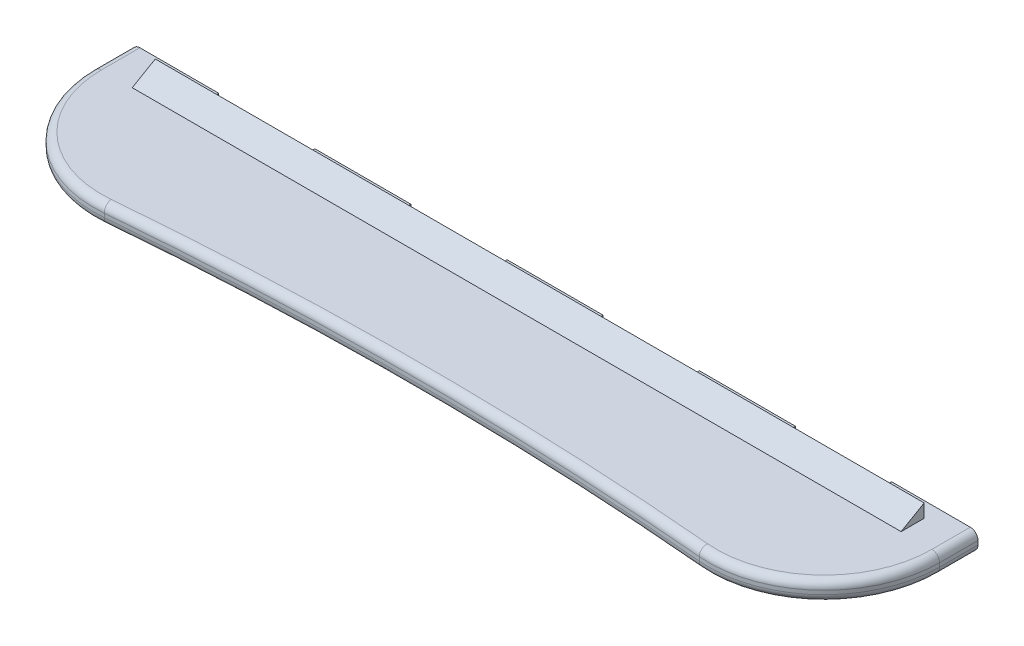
ISO-10303-21;
HEADER;
FILE_DESCRIPTION(('STEP AP214'),'2;1');
FILE_NAME('part.step','',(''),(''),'','','');
FILE_SCHEMA(('AUTOMOTIVE_DESIGN { 1 0 10303 214 1 1 1 1 }'));
ENDSEC;
DATA;
#1=APPLICATION_CONTEXT('core data for automotive mechanical design processes');
#2=APPLICATION_PROTOCOL_DEFINITION('international standard','automotive_design',2000,#1);
#3=PRODUCT_CONTEXT('',#1,'mechanical');
#4=PRODUCT('Part','Part','',(#3));
#5=PRODUCT_RELATED_PRODUCT_CATEGORY('part','',(#4));
#6=PRODUCT_DEFINITION_FORMATION('','',#4);
#7=PRODUCT_DEFINITION_CONTEXT('part definition',#1,'design');
#8=PRODUCT_DEFINITION('design','',#6,#7);
#9=PRODUCT_DEFINITION_SHAPE('','',#8);
#10=(LENGTH_UNIT() NAMED_UNIT(*) SI_UNIT(.MILLI.,.METRE.));
#11=(NAMED_UNIT(*) PLANE_ANGLE_UNIT() SI_UNIT($,.RADIAN.));
#12=(NAMED_UNIT(*) SI_UNIT($,.STERADIAN.) SOLID_ANGLE_UNIT());
#13=UNCERTAINTY_MEASURE_WITH_UNIT(LENGTH_MEASURE(1.E-05),#10,'distance_accuracy_value','');
#14=(GEOMETRIC_REPRESENTATION_CONTEXT(3) GLOBAL_UNCERTAINTY_ASSIGNED_CONTEXT((#13)) GLOBAL_UNIT_ASSIGNED_CONTEXT((#10,
#11,#12)) REPRESENTATION_CONTEXT('',''));
#15=CARTESIAN_POINT('',(0.,0.,0.));
#16=DIRECTION('',(0.,0.,1.));
#17=DIRECTION('',(1.,0.,0.));
#18=AXIS2_PLACEMENT_3D('',#15,#16,#17);
#19=CARTESIAN_POINT('',(-80.,5.,-9.99999999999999));
#20=DIRECTION('',(0.,1.,0.));
#21=DIRECTION('',(0.,0.,1.));
#22=AXIS2_PLACEMENT_3D('',#19,#20,#21);
#23=PLANE('',#22);
#24=DIRECTION('',(0.,0.,1.));
#25=VECTOR('',#24,1.);
#26=CARTESIAN_POINT('',(-62.5,5.,-20.));
#27=LINE('',#26,#25);
#28=CARTESIAN_POINT('',(-62.5,5.,-20.));
#29=VERTEX_POINT('',#28);
#30=CARTESIAN_POINT('',(-62.5,5.,-16.));
#31=VERTEX_POINT('',#30);
#32=EDGE_CURVE('E864',#29,#31,#27,.T.);
#33=ORIENTED_EDGE('',*,*,#32,.T.);
#34=DIRECTION('',(1.,0.,0.));
#35=VECTOR('',#34,1.);
#36=CARTESIAN_POINT('',(-100.,5.,-16.));
#37=LINE('',#36,#35);
#38=CARTESIAN_POINT('',(-37.5,5.,-16.));
#39=VERTEX_POINT('',#38);
#40=EDGE_CURVE('E835',#31,#39,#37,.T.);
#41=ORIENTED_EDGE('',*,*,#40,.T.);
#42=DIRECTION('',(0.,0.,-1.));
#43=VECTOR('',#42,1.);
#44=CARTESIAN_POINT('',(-37.5,5.,-16.));
#45=LINE('',#44,#43);
#46=CARTESIAN_POINT('',(-37.5,5.,-20.));
#47=VERTEX_POINT('',#46);
#48=EDGE_CURVE('E860',#39,#47,#45,.T.);
#49=ORIENTED_EDGE('',*,*,#48,.T.);
#50=DIRECTION('',(-1.,0.,0.));
#51=VECTOR('',#50,1.);
#52=CARTESIAN_POINT('',(-37.5,5.,-20.));
#53=LINE('',#52,#51);
#54=EDGE_CURVE('E862',#47,#29,#53,.T.);
#55=ORIENTED_EDGE('',*,*,#54,.T.);
#56=EDGE_LOOP('',(#33,#41,#49,#55));
#57=FACE_BOUND('',#56,.T.);
#58=ADVANCED_FACE('F36',(#57),#23,.T.);
#59=DIRECTION('',(0.,0.,1.));
#60=VECTOR('',#59,1.);
#61=CARTESIAN_POINT('',(-12.5,5.,-20.));
#62=LINE('',#61,#60);
#63=CARTESIAN_POINT('',(-12.5,5.,-20.));
#64=VERTEX_POINT('',#63);
#65=CARTESIAN_POINT('',(-12.5,5.,-16.));
#66=VERTEX_POINT('',#65);
#67=EDGE_CURVE('E857',#64,#66,#62,.T.);
#68=ORIENTED_EDGE('',*,*,#67,.T.);
#69=CARTESIAN_POINT('',(12.5,5.,-16.));
#70=VERTEX_POINT('',#69);
#71=EDGE_CURVE('E1165',#66,#70,#37,.T.);
#72=ORIENTED_EDGE('',*,*,#71,.T.);
#73=DIRECTION('',(0.,0.,-1.));
#74=VECTOR('',#73,1.);
#75=CARTESIAN_POINT('',(12.5,5.,-16.));
#76=LINE('',#75,#74);
#77=CARTESIAN_POINT('',(12.5,5.,-20.));
#78=VERTEX_POINT('',#77);
#79=EDGE_CURVE('E853',#70,#78,#76,.T.);
#80=ORIENTED_EDGE('',*,*,#79,.T.);
#81=DIRECTION('',(-1.,0.,0.));
#82=VECTOR('',#81,1.);
#83=CARTESIAN_POINT('',(12.5,5.,-20.));
#84=LINE('',#83,#82);
#85=EDGE_CURVE('E855',#78,#64,#84,.T.);
#86=ORIENTED_EDGE('',*,*,#85,.T.);
#87=EDGE_LOOP('',(#68,#72,#80,#86));
#88=FACE_BOUND('',#87,.T.);
#89=ADVANCED_FACE('F1119',(#88),#23,.T.);
#90=DIRECTION('',(0.,0.,1.));
#91=VECTOR('',#90,1.);
#92=CARTESIAN_POINT('',(37.5,5.,-20.));
#93=LINE('',#92,#91);
#94=CARTESIAN_POINT('',(37.5,5.,-20.));
#95=VERTEX_POINT('',#94);
#96=CARTESIAN_POINT('',(37.5,5.,-16.));
#97=VERTEX_POINT('',#96);
#98=EDGE_CURVE('E850',#95,#97,#93,.T.);
#99=ORIENTED_EDGE('',*,*,#98,.T.);
#100=CARTESIAN_POINT('',(62.5,5.,-16.));
#101=VERTEX_POINT('',#100);
#102=EDGE_CURVE('E1140',#97,#101,#37,.T.);
#103=ORIENTED_EDGE('',*,*,#102,.T.);
#104=DIRECTION('',(0.,0.,-1.));
#105=VECTOR('',#104,1.);
#106=CARTESIAN_POINT('',(62.5,5.,-16.));
#107=LINE('',#106,#105);
#108=CARTESIAN_POINT('',(62.5,5.,-20.));
#109=VERTEX_POINT('',#108);
#110=EDGE_CURVE('E846',#101,#109,#107,.T.);
#111=ORIENTED_EDGE('',*,*,#110,.T.);
#112=DIRECTION('',(-1.,0.,0.));
#113=VECTOR('',#112,1.);
#114=CARTESIAN_POINT('',(62.5,5.,-20.));
#115=LINE('',#114,#113);
#116=EDGE_CURVE('E848',#109,#95,#115,.T.);
#117=ORIENTED_EDGE('',*,*,#116,.T.);
#118=EDGE_LOOP('',(#99,#103,#111,#117));
#119=FACE_BOUND('',#118,.T.);
#120=ADVANCED_FACE('F1125',(#119),#23,.T.);
#121=DIRECTION('',(-1.,0.,0.));
#122=VECTOR('',#121,1.);
#123=CARTESIAN_POINT('',(-87.5,5.,-20.));
#124=LINE('',#123,#122);
#125=CARTESIAN_POINT('',(-87.5,5.,-20.));
#126=VERTEX_POINT('',#125);
#127=CARTESIAN_POINT('',(-108.,5.,-20.));
#128=VERTEX_POINT('',#127);
#129=EDGE_CURVE('E837',#126,#128,#124,.T.);
#130=ORIENTED_EDGE('',*,*,#129,.T.);
#131=DIRECTION('',(0.,0.,1.));
#132=VECTOR('',#131,1.);
#133=CARTESIAN_POINT('',(-108.,5.,-9.99999999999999));
#134=LINE('',#133,#132);
#135=CARTESIAN_POINT('',(-108.,5.,-9.99999999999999));
#136=VERTEX_POINT('',#135);
#137=EDGE_CURVE('E976',#128,#136,#134,.T.);
#138=ORIENTED_EDGE('',*,*,#137,.T.);
#139=CARTESIAN_POINT('',(-80.,5.,-9.99999999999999));
#140=DIRECTION('',(0.,1.,0.));
#141=DIRECTION('',(0.,0.,1.));
#142=AXIS2_PLACEMENT_3D('',#139,#140,#141);
#143=CIRCLE('',#142,28.);
#144=CARTESIAN_POINT('',(-77.5596392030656,5.,17.8934515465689));
#145=VERTEX_POINT('',#144);
#146=EDGE_CURVE('E968',#136,#145,#143,.T.);
#147=ORIENTED_EDGE('',*,*,#146,.T.);
#148=CARTESIAN_POINT('',(0.,5.,904.404184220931));
#149=DIRECTION('',(0.,1.,0.));
#150=DIRECTION('',(0.,0.,1.));
#151=AXIS2_PLACEMENT_3D('',#148,#149,#150);
#152=CIRCLE('',#151,889.897059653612);
#153=CARTESIAN_POINT('',(77.5596392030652,5.,17.8934515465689));
#154=VERTEX_POINT('',#153);
#155=EDGE_CURVE('E970',#145,#154,#152,.F.);
#156=ORIENTED_EDGE('',*,*,#155,.T.);
#157=CARTESIAN_POINT('',(80.,5.,-9.99999999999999));
#158=DIRECTION('',(0.,1.,0.));
#159=DIRECTION('',(0.,0.,1.));
#160=AXIS2_PLACEMENT_3D('',#157,#158,#159);
#161=CIRCLE('',#160,28.);
#162=CARTESIAN_POINT('',(108.,5.,-9.99999999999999));
#163=VERTEX_POINT('',#162);
#164=EDGE_CURVE('E972',#154,#163,#161,.T.);
#165=ORIENTED_EDGE('',*,*,#164,.T.);
#166=DIRECTION('',(0.,0.,-1.));
#167=VECTOR('',#166,1.);
#168=CARTESIAN_POINT('',(108.,5.,-20.));
#169=LINE('',#168,#167);
#170=CARTESIAN_POINT('',(108.,5.,-20.));
#171=VERTEX_POINT('',#170);
#172=EDGE_CURVE('E974',#163,#171,#169,.T.);
#173=ORIENTED_EDGE('',*,*,#172,.T.);
#174=DIRECTION('',(-1.,0.,0.));
#175=VECTOR('',#174,1.);
#176=CARTESIAN_POINT('',(110.,5.,-20.));
#177=LINE('',#176,#175);
#178=CARTESIAN_POINT('',(87.5,5.,-20.));
#179=VERTEX_POINT('',#178);
#180=EDGE_CURVE('E840',#171,#179,#177,.T.);
#181=ORIENTED_EDGE('',*,*,#180,.T.);
#182=DIRECTION('',(0.,0.,1.));
#183=VECTOR('',#182,1.);
#184=CARTESIAN_POINT('',(87.5,5.,-20.));
#185=LINE('',#184,#183);
#186=CARTESIAN_POINT('',(87.5,5.,-16.));
#187=VERTEX_POINT('',#186);
#188=EDGE_CURVE('E843',#179,#187,#185,.T.);
#189=ORIENTED_EDGE('',*,*,#188,.T.);
#190=CARTESIAN_POINT('',(100.,5.,-16.));
#191=VERTEX_POINT('',#190);
#192=EDGE_CURVE('E836',#187,#191,#37,.T.);
#193=ORIENTED_EDGE('',*,*,#192,.T.);
#194=DIRECTION('',(0.,0.,-1.));
#195=VECTOR('',#194,1.);
#196=CARTESIAN_POINT('',(100.,5.,-16.));
#197=LINE('',#196,#195);
#198=CARTESIAN_POINT('',(100.,5.,-9.99999999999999));
#199=VERTEX_POINT('',#198);
#200=EDGE_CURVE('E520',#199,#191,#197,.T.);
#201=ORIENTED_EDGE('',*,*,#200,.F.);
#202=DIRECTION('',(1.,0.,0.));
#203=VECTOR('',#202,1.);
#204=CARTESIAN_POINT('',(-100.,5.,-9.99999999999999));
#205=LINE('',#204,#203);
#206=CARTESIAN_POINT('',(-100.,5.,-9.99999999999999));
#207=VERTEX_POINT('',#206);
#208=EDGE_CURVE('E829',#207,#199,#205,.T.);
#209=ORIENTED_EDGE('',*,*,#208,.F.);
#210=DIRECTION('',(0.,0.,-1.));
#211=VECTOR('',#210,1.);
#212=CARTESIAN_POINT('',(-100.,5.,-16.));
#213=LINE('',#212,#211);
#214=CARTESIAN_POINT('',(-100.,5.,-16.));
#215=VERTEX_POINT('',#214);
#216=EDGE_CURVE('E812',#207,#215,#213,.T.);
#217=ORIENTED_EDGE('',*,*,#216,.T.);
#218=CARTESIAN_POINT('',(-87.5,5.,-16.));
#219=VERTEX_POINT('',#218);
#220=EDGE_CURVE('E822',#215,#219,#37,.T.);
#221=ORIENTED_EDGE('',*,*,#220,.T.);
#222=DIRECTION('',(0.,0.,-1.));
#223=VECTOR('',#222,1.);
#224=CARTESIAN_POINT('',(-87.5,5.,-16.));
#225=LINE('',#224,#223);
#226=EDGE_CURVE('E867',#219,#126,#225,.T.);
#227=ORIENTED_EDGE('',*,*,#226,.T.);
#228=EDGE_LOOP('',(#130,#138,#147,#156,#165,#173,#181,#189,#193,#201,#209,#217,#221,#227));
#229=FACE_BOUND('',#228,.T.);
#230=ADVANCED_FACE('F1090',(#229),#23,.T.);
#231=CARTESIAN_POINT('',(-87.5,5.,-20.));
#232=DIRECTION('',(0.,0.,1.));
#233=DIRECTION('',(1.,0.,0.));
#234=AXIS2_PLACEMENT_3D('',#231,#232,#233);
#235=PLANE('',#234);
#236=DIRECTION('',(0.,-1.,0.));
#237=VECTOR('',#236,1.);
#238=CARTESIAN_POINT('',(-110.,5.,-20.));
#239=LINE('',#238,#237);
#240=CARTESIAN_POINT('',(-110.,3.,-20.));
#241=VERTEX_POINT('',#240);
#242=CARTESIAN_POINT('',(-110.,2.,-20.));
#243=VERTEX_POINT('',#242);
#244=EDGE_CURVE('E965',#241,#243,#239,.T.);
#245=ORIENTED_EDGE('',*,*,#244,.F.);
#246=CARTESIAN_POINT('',(-108.,3.,-20.));
#247=DIRECTION('',(0.,0.,1.));
#248=DIRECTION('',(1.,0.,0.));
#249=AXIS2_PLACEMENT_3D('',#246,#247,#248);
#250=CIRCLE('',#249,2.);
#251=EDGE_CURVE('E986',#241,#128,#250,.F.);
#252=ORIENTED_EDGE('',*,*,#251,.T.);
#253=ORIENTED_EDGE('',*,*,#129,.F.);
#254=DIRECTION('',(0.,-1.,0.));
#255=VECTOR('',#254,1.);
#256=CARTESIAN_POINT('',(-87.5,5.,-20.));
#257=LINE('',#256,#255);
#258=CARTESIAN_POINT('',(-87.5,0.,-20.));
#259=VERTEX_POINT('',#258);
#260=EDGE_CURVE('E869',#126,#259,#257,.T.);
#261=ORIENTED_EDGE('',*,*,#260,.T.);
#262=DIRECTION('',(-1.,0.,0.));
#263=VECTOR('',#262,1.);
#264=CARTESIAN_POINT('',(-87.5,0.,-20.));
#265=LINE('',#264,#263);
#266=CARTESIAN_POINT('',(-108.,0.,-20.));
#267=VERTEX_POINT('',#266);
#268=EDGE_CURVE('E831',#259,#267,#265,.T.);
#269=ORIENTED_EDGE('',*,*,#268,.T.);
#270=CARTESIAN_POINT('',(-108.,2.,-20.));
#271=DIRECTION('',(0.,0.,1.));
#272=DIRECTION('',(1.,0.,0.));
#273=AXIS2_PLACEMENT_3D('',#270,#271,#272);
#274=CIRCLE('',#273,2.);
#275=EDGE_CURVE('E984',#267,#243,#274,.F.);
#276=ORIENTED_EDGE('',*,*,#275,.T.);
#277=EDGE_LOOP('',(#245,#252,#253,#261,#269,#276));
#278=FACE_BOUND('',#277,.T.);
#279=ADVANCED_FACE('F1088',(#278),#235,.F.);
#280=CARTESIAN_POINT('',(-110.,5.,-9.99999999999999));
#281=DIRECTION('',(1.,0.,0.));
#282=DIRECTION('',(0.,0.,-1.));
#283=AXIS2_PLACEMENT_3D('',#280,#281,#282);
#284=PLANE('',#283);
#285=DIRECTION('',(0.,-1.,0.));
#286=VECTOR('',#285,1.);
#287=CARTESIAN_POINT('',(-110.,5.,-9.99999999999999));
#288=LINE('',#287,#286);
#289=CARTESIAN_POINT('',(-110.,3.,-9.99999999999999));
#290=VERTEX_POINT('',#289);
#291=CARTESIAN_POINT('',(-110.,2.,-9.99999999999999));
#292=VERTEX_POINT('',#291);
#293=EDGE_CURVE('E962',#290,#292,#288,.T.);
#294=ORIENTED_EDGE('',*,*,#293,.F.);
#295=DIRECTION('',(0.,0.,1.));
#296=VECTOR('',#295,1.);
#297=CARTESIAN_POINT('',(-110.,3.,-20.));
#298=LINE('',#297,#296);
#299=EDGE_CURVE('E982',#290,#241,#298,.F.);
#300=ORIENTED_EDGE('',*,*,#299,.T.);
#301=ORIENTED_EDGE('',*,*,#244,.T.);
#302=DIRECTION('',(0.,0.,1.));
#303=VECTOR('',#302,1.);
#304=CARTESIAN_POINT('',(-110.,2.,-9.99999999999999));
#305=LINE('',#304,#303);
#306=EDGE_CURVE('E979',#243,#292,#305,.T.);
#307=ORIENTED_EDGE('',*,*,#306,.T.);
#308=EDGE_LOOP('',(#294,#300,#301,#307));
#309=FACE_BOUND('',#308,.T.);
#310=ADVANCED_FACE('F1079',(#309),#284,.F.);
#311=CARTESIAN_POINT('',(-80.,5.,-9.99999999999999));
#312=DIRECTION('',(0.,-1.,0.));
#313=DIRECTION('',(0.,0.,-1.));
#314=AXIS2_PLACEMENT_3D('',#311,#312,#313);
#315=CYLINDRICAL_SURFACE('',#314,30.);
#316=DIRECTION('',(0.,-1.,0.));
#317=VECTOR('',#316,1.);
#318=CARTESIAN_POINT('',(-77.3853277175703,5.,19.8858409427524));
#319=LINE('',#318,#317);
#320=CARTESIAN_POINT('',(-77.3853277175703,3.,19.8858409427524));
#321=VERTEX_POINT('',#320);
#322=CARTESIAN_POINT('',(-77.3853277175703,2.,19.8858409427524));
#323=VERTEX_POINT('',#322);
#324=EDGE_CURVE('E959',#321,#323,#319,.T.);
#325=ORIENTED_EDGE('',*,*,#324,.F.);
#326=CARTESIAN_POINT('',(-80.,3.,-9.99999999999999));
#327=DIRECTION('',(0.,1.,0.));
#328=DIRECTION('',(0.,0.,1.));
#329=AXIS2_PLACEMENT_3D('',#326,#327,#328);
#330=CIRCLE('',#329,30.);
#331=EDGE_CURVE('E11',#321,#290,#330,.F.);
#332=ORIENTED_EDGE('',*,*,#331,.T.);
#333=ORIENTED_EDGE('',*,*,#293,.T.);
#334=CARTESIAN_POINT('',(-80.,2.,-9.99999999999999));
#335=DIRECTION('',(0.,1.,0.));
#336=DIRECTION('',(0.,0.,1.));
#337=AXIS2_PLACEMENT_3D('',#334,#335,#336);
#338=CIRCLE('',#337,30.);
#339=EDGE_CURVE('E45',#292,#323,#338,.T.);
#340=ORIENTED_EDGE('',*,*,#339,.T.);
#341=EDGE_LOOP('',(#325,#332,#333,#340));
#342=FACE_BOUND('',#341,.T.);
#343=ADVANCED_FACE('F1076',(#342),#315,.T.);
#344=CARTESIAN_POINT('',(0.,5.,904.404184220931));
#345=DIRECTION('',(0.,-1.,0.));
#346=DIRECTION('',(0.,0.,-1.));
#347=AXIS2_PLACEMENT_3D('',#344,#345,#346);
#348=CYLINDRICAL_SURFACE('',#347,887.897059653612);
#349=DIRECTION('',(0.,-1.,0.));
#350=VECTOR('',#349,1.);
#351=CARTESIAN_POINT('',(77.3853277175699,5.,19.8858409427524));
#352=LINE('',#351,#350);
#353=CARTESIAN_POINT('',(77.3853277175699,3.,19.8858409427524));
#354=VERTEX_POINT('',#353);
#355=CARTESIAN_POINT('',(77.3853277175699,2.,19.8858409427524));
#356=VERTEX_POINT('',#355);
#357=EDGE_CURVE('E956',#354,#356,#352,.T.);
#358=ORIENTED_EDGE('',*,*,#357,.F.);
#359=CARTESIAN_POINT('',(0.,3.,904.404184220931));
#360=DIRECTION('',(0.,1.,0.));
#361=DIRECTION('',(0.,0.,1.));
#362=AXIS2_PLACEMENT_3D('',#359,#360,#361);
#363=CIRCLE('',#362,887.897059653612);
#364=EDGE_CURVE('E1002',#354,#321,#363,.T.);
#365=ORIENTED_EDGE('',*,*,#364,.T.);
#366=ORIENTED_EDGE('',*,*,#324,.T.);
#367=CARTESIAN_POINT('',(0.,2.,904.404184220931));
#368=DIRECTION('',(0.,1.,0.));
#369=DIRECTION('',(0.,0.,1.));
#370=AXIS2_PLACEMENT_3D('',#367,#368,#369);
#371=CIRCLE('',#370,887.897059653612);
#372=EDGE_CURVE('E1000',#323,#356,#371,.F.);
#373=ORIENTED_EDGE('',*,*,#372,.T.);
#374=EDGE_LOOP('',(#358,#365,#366,#373));
#375=FACE_BOUND('',#374,.T.);
#376=ADVANCED_FACE('F1059',(#375),#348,.F.);
#377=CARTESIAN_POINT('',(80.,5.,-9.99999999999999));
#378=DIRECTION('',(0.,-1.,0.));
#379=DIRECTION('',(0.,0.,-1.));
#380=AXIS2_PLACEMENT_3D('',#377,#378,#379);
#381=CYLINDRICAL_SURFACE('',#380,30.);
#382=DIRECTION('',(0.,-1.,0.));
#383=VECTOR('',#382,1.);
#384=CARTESIAN_POINT('',(110.,5.,-9.99999999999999));
#385=LINE('',#384,#383);
#386=CARTESIAN_POINT('',(110.,3.,-9.99999999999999));
#387=VERTEX_POINT('',#386);
#388=CARTESIAN_POINT('',(110.,2.,-9.99999999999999));
#389=VERTEX_POINT('',#388);
#390=EDGE_CURVE('E953',#387,#389,#385,.T.);
#391=ORIENTED_EDGE('',*,*,#390,.F.);
#392=CARTESIAN_POINT('',(80.,3.,-9.99999999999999));
#393=DIRECTION('',(0.,1.,0.));
#394=DIRECTION('',(0.,0.,1.));
#395=AXIS2_PLACEMENT_3D('',#392,#393,#394);
#396=CIRCLE('',#395,30.);
#397=EDGE_CURVE('E998',#387,#354,#396,.F.);
#398=ORIENTED_EDGE('',*,*,#397,.T.);
#399=ORIENTED_EDGE('',*,*,#357,.T.);
#400=CARTESIAN_POINT('',(80.,2.,-9.99999999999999));
#401=DIRECTION('',(0.,1.,0.));
#402=DIRECTION('',(0.,0.,1.));
#403=AXIS2_PLACEMENT_3D('',#400,#401,#402);
#404=CIRCLE('',#403,30.);
#405=EDGE_CURVE('E996',#356,#389,#404,.T.);
#406=ORIENTED_EDGE('',*,*,#405,.T.);
#407=EDGE_LOOP('',(#391,#398,#399,#406));
#408=FACE_BOUND('',#407,.T.);
#409=ADVANCED_FACE('F1055',(#408),#381,.T.);
#410=CARTESIAN_POINT('',(110.,5.,-9.99999999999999));
#411=DIRECTION('',(-1.,0.,0.));
#412=DIRECTION('',(0.,0.,1.));
#413=AXIS2_PLACEMENT_3D('',#410,#411,#412);
#414=PLANE('',#413);
#415=DIRECTION('',(0.,-1.,0.));
#416=VECTOR('',#415,1.);
#417=CARTESIAN_POINT('',(110.,5.,-20.));
#418=LINE('',#417,#416);
#419=CARTESIAN_POINT('',(110.,3.,-20.));
#420=VERTEX_POINT('',#419);
#421=CARTESIAN_POINT('',(110.,2.,-20.));
#422=VERTEX_POINT('',#421);
#423=EDGE_CURVE('E950',#420,#422,#418,.T.);
#424=ORIENTED_EDGE('',*,*,#423,.F.);
#425=DIRECTION('',(0.,0.,-1.));
#426=VECTOR('',#425,1.);
#427=CARTESIAN_POINT('',(110.,3.,-9.99999999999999));
#428=LINE('',#427,#426);
#429=EDGE_CURVE('E994',#420,#387,#428,.F.);
#430=ORIENTED_EDGE('',*,*,#429,.T.);
#431=ORIENTED_EDGE('',*,*,#390,.T.);
#432=DIRECTION('',(0.,0.,-1.));
#433=VECTOR('',#432,1.);
#434=CARTESIAN_POINT('',(110.,2.,-9.99999999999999));
#435=LINE('',#434,#433);
#436=EDGE_CURVE('E992',#389,#422,#435,.T.);
#437=ORIENTED_EDGE('',*,*,#436,.T.);
#438=EDGE_LOOP('',(#424,#430,#431,#437));
#439=FACE_BOUND('',#438,.T.);
#440=ADVANCED_FACE('F1041',(#439),#414,.F.);
#441=CARTESIAN_POINT('',(110.,5.,-20.));
#442=DIRECTION('',(0.,0.,1.));
#443=DIRECTION('',(1.,0.,0.));
#444=AXIS2_PLACEMENT_3D('',#441,#442,#443);
#445=PLANE('',#444);
#446=ORIENTED_EDGE('',*,*,#180,.F.);
#447=CARTESIAN_POINT('',(108.,3.,-20.));
#448=DIRECTION('',(0.,0.,1.));
#449=DIRECTION('',(1.,0.,0.));
#450=AXIS2_PLACEMENT_3D('',#447,#448,#449);
#451=CIRCLE('',#450,2.);
#452=EDGE_CURVE('E990',#171,#420,#451,.F.);
#453=ORIENTED_EDGE('',*,*,#452,.T.);
#454=ORIENTED_EDGE('',*,*,#423,.T.);
#455=CARTESIAN_POINT('',(108.,2.,-20.));
#456=DIRECTION('',(0.,0.,1.));
#457=DIRECTION('',(1.,0.,0.));
#458=AXIS2_PLACEMENT_3D('',#455,#456,#457);
#459=CIRCLE('',#458,2.);
#460=CARTESIAN_POINT('',(108.,0.,-20.));
#461=VERTEX_POINT('',#460);
#462=EDGE_CURVE('E988',#422,#461,#459,.F.);
#463=ORIENTED_EDGE('',*,*,#462,.T.);
#464=DIRECTION('',(-1.,0.,0.));
#465=VECTOR('',#464,1.);
#466=CARTESIAN_POINT('',(110.,0.,-20.));
#467=LINE('',#466,#465);
#468=CARTESIAN_POINT('',(87.5,0.,-20.));
#469=VERTEX_POINT('',#468);
#470=EDGE_CURVE('E872',#461,#469,#467,.T.);
#471=ORIENTED_EDGE('',*,*,#470,.T.);
#472=DIRECTION('',(0.,-1.,0.));
#473=VECTOR('',#472,1.);
#474=CARTESIAN_POINT('',(87.5,5.,-20.));
#475=LINE('',#474,#473);
#476=EDGE_CURVE('E947',#179,#469,#475,.T.);
#477=ORIENTED_EDGE('',*,*,#476,.F.);
#478=EDGE_LOOP('',(#446,#453,#454,#463,#471,#477));
#479=FACE_BOUND('',#478,.T.);
#480=ADVANCED_FACE('F1046',(#479),#445,.F.);
#481=CARTESIAN_POINT('',(87.5,5.,-20.));
#482=DIRECTION('',(1.,0.,0.));
#483=DIRECTION('',(0.,0.,-1.));
#484=AXIS2_PLACEMENT_3D('',#481,#482,#483);
#485=PLANE('',#484);
#486=DIRECTION('',(0.,0.,1.));
#487=VECTOR('',#486,1.);
#488=CARTESIAN_POINT('',(87.5,0.,-20.));
#489=LINE('',#488,#487);
#490=CARTESIAN_POINT('',(87.5,0.,-16.));
#491=VERTEX_POINT('',#490);
#492=EDGE_CURVE('E874',#469,#491,#489,.T.);
#493=ORIENTED_EDGE('',*,*,#492,.T.);
#494=DIRECTION('',(0.,-1.,0.));
#495=VECTOR('',#494,1.);
#496=CARTESIAN_POINT('',(87.5,5.,-16.));
#497=LINE('',#496,#495);
#498=EDGE_CURVE('E944',#187,#491,#497,.T.);
#499=ORIENTED_EDGE('',*,*,#498,.F.);
#500=ORIENTED_EDGE('',*,*,#188,.F.);
#501=ORIENTED_EDGE('',*,*,#476,.T.);
#502=EDGE_LOOP('',(#493,#499,#500,#501));
#503=FACE_BOUND('',#502,.T.);
#504=ADVANCED_FACE('F1222',(#503),#485,.F.);
#505=CARTESIAN_POINT('',(62.5,5.,-16.));
#506=DIRECTION('',(-1.,0.,0.));
#507=DIRECTION('',(0.,0.,1.));
#508=AXIS2_PLACEMENT_3D('',#505,#506,#507);
#509=PLANE('',#508);
#510=DIRECTION('',(0.,0.,-1.));
#511=VECTOR('',#510,1.);
#512=CARTESIAN_POINT('',(62.5,0.,-16.));
#513=LINE('',#512,#511);
#514=CARTESIAN_POINT('',(62.5,0.,-16.));
#515=VERTEX_POINT('',#514);
#516=CARTESIAN_POINT('',(62.5,0.,-20.));
#517=VERTEX_POINT('',#516);
#518=EDGE_CURVE('E878',#515,#517,#513,.T.);
#519=ORIENTED_EDGE('',*,*,#518,.T.);
#520=DIRECTION('',(0.,-1.,0.));
#521=VECTOR('',#520,1.);
#522=CARTESIAN_POINT('',(62.5,5.,-20.));
#523=LINE('',#522,#521);
#524=EDGE_CURVE('E938',#109,#517,#523,.T.);
#525=ORIENTED_EDGE('',*,*,#524,.F.);
#526=ORIENTED_EDGE('',*,*,#110,.F.);
#527=DIRECTION('',(0.,-1.,0.));
#528=VECTOR('',#527,1.);
#529=CARTESIAN_POINT('',(62.5,5.,-16.));
#530=LINE('',#529,#528);
#531=EDGE_CURVE('E941',#101,#515,#530,.T.);
#532=ORIENTED_EDGE('',*,*,#531,.T.);
#533=EDGE_LOOP('',(#519,#525,#526,#532));
#534=FACE_BOUND('',#533,.T.);
#535=ADVANCED_FACE('F1218',(#534),#509,.F.);
#536=CARTESIAN_POINT('',(62.5,5.,-20.));
#537=DIRECTION('',(0.,0.,1.));
#538=DIRECTION('',(1.,0.,0.));
#539=AXIS2_PLACEMENT_3D('',#536,#537,#538);
#540=PLANE('',#539);
#541=DIRECTION('',(-1.,0.,0.));
#542=VECTOR('',#541,1.);
#543=CARTESIAN_POINT('',(62.5,0.,-20.));
#544=LINE('',#543,#542);
#545=CARTESIAN_POINT('',(37.5,0.,-20.));
#546=VERTEX_POINT('',#545);
#547=EDGE_CURVE('E880',#517,#546,#544,.T.);
#548=ORIENTED_EDGE('',*,*,#547,.T.);
#549=DIRECTION('',(0.,-1.,0.));
#550=VECTOR('',#549,1.);
#551=CARTESIAN_POINT('',(37.5,5.,-20.));
#552=LINE('',#551,#550);
#553=EDGE_CURVE('E935',#95,#546,#552,.T.);
#554=ORIENTED_EDGE('',*,*,#553,.F.);
#555=ORIENTED_EDGE('',*,*,#116,.F.);
#556=ORIENTED_EDGE('',*,*,#524,.T.);
#557=EDGE_LOOP('',(#548,#554,#555,#556));
#558=FACE_BOUND('',#557,.T.);
#559=ADVANCED_FACE('F1215',(#558),#540,.F.);
#560=CARTESIAN_POINT('',(37.5,5.,-20.));
#561=DIRECTION('',(1.,0.,0.));
#562=DIRECTION('',(0.,0.,-1.));
#563=AXIS2_PLACEMENT_3D('',#560,#561,#562);
#564=PLANE('',#563);
#565=DIRECTION('',(0.,0.,1.));
#566=VECTOR('',#565,1.);
#567=CARTESIAN_POINT('',(37.5,0.,-20.));
#568=LINE('',#567,#566);
#569=CARTESIAN_POINT('',(37.5,0.,-16.));
#570=VERTEX_POINT('',#569);
#571=EDGE_CURVE('E882',#546,#570,#568,.T.);
#572=ORIENTED_EDGE('',*,*,#571,.T.);
#573=DIRECTION('',(0.,-1.,0.));
#574=VECTOR('',#573,1.);
#575=CARTESIAN_POINT('',(37.5,5.,-16.));
#576=LINE('',#575,#574);
#577=EDGE_CURVE('E932',#97,#570,#576,.T.);
#578=ORIENTED_EDGE('',*,*,#577,.F.);
#579=ORIENTED_EDGE('',*,*,#98,.F.);
#580=ORIENTED_EDGE('',*,*,#553,.T.);
#581=EDGE_LOOP('',(#572,#578,#579,#580));
#582=FACE_BOUND('',#581,.T.);
#583=ADVANCED_FACE('F1145',(#582),#564,.F.);
#584=CARTESIAN_POINT('',(12.5,5.,-16.));
#585=DIRECTION('',(-1.,0.,0.));
#586=DIRECTION('',(0.,0.,1.));
#587=AXIS2_PLACEMENT_3D('',#584,#585,#586);
#588=PLANE('',#587);
#589=DIRECTION('',(0.,0.,-1.));
#590=VECTOR('',#589,1.);
#591=CARTESIAN_POINT('',(12.5,0.,-16.));
#592=LINE('',#591,#590);
#593=CARTESIAN_POINT('',(12.5,0.,-16.));
#594=VERTEX_POINT('',#593);
#595=CARTESIAN_POINT('',(12.5,0.,-20.));
#596=VERTEX_POINT('',#595);
#597=EDGE_CURVE('E886',#594,#596,#592,.T.);
#598=ORIENTED_EDGE('',*,*,#597,.T.);
#599=DIRECTION('',(0.,-1.,0.));
#600=VECTOR('',#599,1.);
#601=CARTESIAN_POINT('',(12.5,5.,-20.));
#602=LINE('',#601,#600);
#603=EDGE_CURVE('E926',#78,#596,#602,.T.);
#604=ORIENTED_EDGE('',*,*,#603,.F.);
#605=ORIENTED_EDGE('',*,*,#79,.F.);
#606=DIRECTION('',(0.,-1.,0.));
#607=VECTOR('',#606,1.);
#608=CARTESIAN_POINT('',(12.5,5.,-16.));
#609=LINE('',#608,#607);
#610=EDGE_CURVE('E929',#70,#594,#609,.T.);
#611=ORIENTED_EDGE('',*,*,#610,.T.);
#612=EDGE_LOOP('',(#598,#604,#605,#611));
#613=FACE_BOUND('',#612,.T.);
#614=ADVANCED_FACE('F1157',(#613),#588,.F.);
#615=CARTESIAN_POINT('',(12.5,5.,-20.));
#616=DIRECTION('',(0.,0.,1.));
#617=DIRECTION('',(1.,0.,0.));
#618=AXIS2_PLACEMENT_3D('',#615,#616,#617);
#619=PLANE('',#618);
#620=DIRECTION('',(-1.,0.,0.));
#621=VECTOR('',#620,1.);
#622=CARTESIAN_POINT('',(12.5,0.,-20.));
#623=LINE('',#622,#621);
#624=CARTESIAN_POINT('',(-12.5,0.,-20.));
#625=VERTEX_POINT('',#624);
#626=EDGE_CURVE('E888',#596,#625,#623,.T.);
#627=ORIENTED_EDGE('',*,*,#626,.T.);
#628=DIRECTION('',(0.,-1.,0.));
#629=VECTOR('',#628,1.);
#630=CARTESIAN_POINT('',(-12.5,5.,-20.));
#631=LINE('',#630,#629);
#632=EDGE_CURVE('E923',#64,#625,#631,.T.);
#633=ORIENTED_EDGE('',*,*,#632,.F.);
#634=ORIENTED_EDGE('',*,*,#85,.F.);
#635=ORIENTED_EDGE('',*,*,#603,.T.);
#636=EDGE_LOOP('',(#627,#633,#634,#635));
#637=FACE_BOUND('',#636,.T.);
#638=ADVANCED_FACE('F1161',(#637),#619,.F.);
#639=CARTESIAN_POINT('',(-12.5,5.,-20.));
#640=DIRECTION('',(1.,0.,0.));
#641=DIRECTION('',(0.,0.,-1.));
#642=AXIS2_PLACEMENT_3D('',#639,#640,#641);
#643=PLANE('',#642);
#644=DIRECTION('',(0.,0.,1.));
#645=VECTOR('',#644,1.);
#646=CARTESIAN_POINT('',(-12.5,0.,-20.));
#647=LINE('',#646,#645);
#648=CARTESIAN_POINT('',(-12.5,0.,-16.));
#649=VERTEX_POINT('',#648);
#650=EDGE_CURVE('E890',#625,#649,#647,.T.);
#651=ORIENTED_EDGE('',*,*,#650,.T.);
#652=DIRECTION('',(0.,-1.,0.));
#653=VECTOR('',#652,1.);
#654=CARTESIAN_POINT('',(-12.5,5.,-16.));
#655=LINE('',#654,#653);
#656=EDGE_CURVE('E920',#66,#649,#655,.T.);
#657=ORIENTED_EDGE('',*,*,#656,.F.);
#658=ORIENTED_EDGE('',*,*,#67,.F.);
#659=ORIENTED_EDGE('',*,*,#632,.T.);
#660=EDGE_LOOP('',(#651,#657,#658,#659));
#661=FACE_BOUND('',#660,.T.);
#662=ADVANCED_FACE('F1200',(#661),#643,.F.);
#663=CARTESIAN_POINT('',(-37.5,5.,-16.));
#664=DIRECTION('',(-1.,0.,0.));
#665=DIRECTION('',(0.,0.,1.));
#666=AXIS2_PLACEMENT_3D('',#663,#664,#665);
#667=PLANE('',#666);
#668=DIRECTION('',(0.,0.,-1.));
#669=VECTOR('',#668,1.);
#670=CARTESIAN_POINT('',(-37.5,0.,-16.));
#671=LINE('',#670,#669);
#672=CARTESIAN_POINT('',(-37.5,0.,-16.));
#673=VERTEX_POINT('',#672);
#674=CARTESIAN_POINT('',(-37.5,0.,-20.));
#675=VERTEX_POINT('',#674);
#676=EDGE_CURVE('E894',#673,#675,#671,.T.);
#677=ORIENTED_EDGE('',*,*,#676,.T.);
#678=DIRECTION('',(0.,-1.,0.));
#679=VECTOR('',#678,1.);
#680=CARTESIAN_POINT('',(-37.5,5.,-20.));
#681=LINE('',#680,#679);
#682=EDGE_CURVE('E914',#47,#675,#681,.T.);
#683=ORIENTED_EDGE('',*,*,#682,.F.);
#684=ORIENTED_EDGE('',*,*,#48,.F.);
#685=DIRECTION('',(0.,-1.,0.));
#686=VECTOR('',#685,1.);
#687=CARTESIAN_POINT('',(-37.5,5.,-16.));
#688=LINE('',#687,#686);
#689=EDGE_CURVE('E917',#39,#673,#688,.T.);
#690=ORIENTED_EDGE('',*,*,#689,.T.);
#691=EDGE_LOOP('',(#677,#683,#684,#690));
#692=FACE_BOUND('',#691,.T.);
#693=ADVANCED_FACE('F1196',(#692),#667,.F.);
#694=CARTESIAN_POINT('',(-37.5,5.,-20.));
#695=DIRECTION('',(0.,0.,1.));
#696=DIRECTION('',(1.,0.,0.));
#697=AXIS2_PLACEMENT_3D('',#694,#695,#696);
#698=PLANE('',#697);
#699=DIRECTION('',(-1.,0.,0.));
#700=VECTOR('',#699,1.);
#701=CARTESIAN_POINT('',(-37.5,0.,-20.));
#702=LINE('',#701,#700);
#703=CARTESIAN_POINT('',(-62.5,0.,-20.));
#704=VERTEX_POINT('',#703);
#705=EDGE_CURVE('E896',#675,#704,#702,.T.);
#706=ORIENTED_EDGE('',*,*,#705,.T.);
#707=DIRECTION('',(0.,-1.,0.));
#708=VECTOR('',#707,1.);
#709=CARTESIAN_POINT('',(-62.5,5.,-20.));
#710=LINE('',#709,#708);
#711=EDGE_CURVE('E911',#29,#704,#710,.T.);
#712=ORIENTED_EDGE('',*,*,#711,.F.);
#713=ORIENTED_EDGE('',*,*,#54,.F.);
#714=ORIENTED_EDGE('',*,*,#682,.T.);
#715=EDGE_LOOP('',(#706,#712,#713,#714));
#716=FACE_BOUND('',#715,.T.);
#717=ADVANCED_FACE('F1192',(#716),#698,.F.);
#718=CARTESIAN_POINT('',(-62.5,5.,-20.));
#719=DIRECTION('',(1.,0.,0.));
#720=DIRECTION('',(0.,0.,-1.));
#721=AXIS2_PLACEMENT_3D('',#718,#719,#720);
#722=PLANE('',#721);
#723=DIRECTION('',(0.,0.,1.));
#724=VECTOR('',#723,1.);
#725=CARTESIAN_POINT('',(-62.5,0.,-20.));
#726=LINE('',#725,#724);
#727=CARTESIAN_POINT('',(-62.5,0.,-16.));
#728=VERTEX_POINT('',#727);
#729=EDGE_CURVE('E898',#704,#728,#726,.T.);
#730=ORIENTED_EDGE('',*,*,#729,.T.);
#731=DIRECTION('',(0.,-1.,0.));
#732=VECTOR('',#731,1.);
#733=CARTESIAN_POINT('',(-62.5,5.,-16.));
#734=LINE('',#733,#732);
#735=EDGE_CURVE('E908',#31,#728,#734,.T.);
#736=ORIENTED_EDGE('',*,*,#735,.F.);
#737=ORIENTED_EDGE('',*,*,#32,.F.);
#738=ORIENTED_EDGE('',*,*,#711,.T.);
#739=EDGE_LOOP('',(#730,#736,#737,#738));
#740=FACE_BOUND('',#739,.T.);
#741=ADVANCED_FACE('F1187',(#740),#722,.F.);
#742=CARTESIAN_POINT('',(-62.5,5.,-16.));
#743=DIRECTION('',(0.,0.,1.));
#744=DIRECTION('',(1.,0.,0.));
#745=AXIS2_PLACEMENT_3D('',#742,#743,#744);
#746=PLANE('',#745);
#747=DIRECTION('',(-1.,0.,0.));
#748=VECTOR('',#747,1.);
#749=CARTESIAN_POINT('',(-62.5,0.,-16.));
#750=LINE('',#749,#748);
#751=CARTESIAN_POINT('',(-87.5,0.,-16.));
#752=VERTEX_POINT('',#751);
#753=EDGE_CURVE('E900',#728,#752,#750,.T.);
#754=ORIENTED_EDGE('',*,*,#753,.T.);
#755=DIRECTION('',(0.,-1.,0.));
#756=VECTOR('',#755,1.);
#757=CARTESIAN_POINT('',(-87.5,5.,-16.));
#758=LINE('',#757,#756);
#759=EDGE_CURVE('E905',#219,#752,#758,.T.);
#760=ORIENTED_EDGE('',*,*,#759,.F.);
#761=ORIENTED_EDGE('',*,*,#220,.F.);
#762=DIRECTION('',(0.,1.,0.));
#763=VECTOR('',#762,1.);
#764=CARTESIAN_POINT('',(-100.,8.46410161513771,-16.));
#765=LINE('',#764,#763);
#766=CARTESIAN_POINT('',(-100.,8.46410161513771,-16.));
#767=VERTEX_POINT('',#766);
#768=EDGE_CURVE('E815',#215,#767,#765,.T.);
#769=ORIENTED_EDGE('',*,*,#768,.T.);
#770=DIRECTION('',(1.,0.,0.));
#771=VECTOR('',#770,1.);
#772=CARTESIAN_POINT('',(-100.,8.46410161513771,-16.));
#773=LINE('',#772,#771);
#774=CARTESIAN_POINT('',(100.,8.46410161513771,-16.));
#775=VERTEX_POINT('',#774);
#776=EDGE_CURVE('E832',#767,#775,#773,.T.);
#777=ORIENTED_EDGE('',*,*,#776,.T.);
#778=DIRECTION('',(0.,1.,0.));
#779=VECTOR('',#778,1.);
#780=CARTESIAN_POINT('',(100.,8.46410161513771,-16.));
#781=LINE('',#780,#779);
#782=EDGE_CURVE('E824',#191,#775,#781,.T.);
#783=ORIENTED_EDGE('',*,*,#782,.F.);
#784=ORIENTED_EDGE('',*,*,#192,.F.);
#785=ORIENTED_EDGE('',*,*,#498,.T.);
#786=DIRECTION('',(-1.,0.,0.));
#787=VECTOR('',#786,1.);
#788=CARTESIAN_POINT('',(87.5,0.,-16.));
#789=LINE('',#788,#787);
#790=EDGE_CURVE('E876',#491,#515,#789,.T.);
#791=ORIENTED_EDGE('',*,*,#790,.T.);
#792=ORIENTED_EDGE('',*,*,#531,.F.);
#793=ORIENTED_EDGE('',*,*,#102,.F.);
#794=ORIENTED_EDGE('',*,*,#577,.T.);
#795=DIRECTION('',(-1.,0.,0.));
#796=VECTOR('',#795,1.);
#797=CARTESIAN_POINT('',(37.5,0.,-16.));
#798=LINE('',#797,#796);
#799=EDGE_CURVE('E884',#570,#594,#798,.T.);
#800=ORIENTED_EDGE('',*,*,#799,.T.);
#801=ORIENTED_EDGE('',*,*,#610,.F.);
#802=ORIENTED_EDGE('',*,*,#71,.F.);
#803=ORIENTED_EDGE('',*,*,#656,.T.);
#804=DIRECTION('',(-1.,0.,0.));
#805=VECTOR('',#804,1.);
#806=CARTESIAN_POINT('',(-12.5,0.,-16.));
#807=LINE('',#806,#805);
#808=EDGE_CURVE('E892',#649,#673,#807,.T.);
#809=ORIENTED_EDGE('',*,*,#808,.T.);
#810=ORIENTED_EDGE('',*,*,#689,.F.);
#811=ORIENTED_EDGE('',*,*,#40,.F.);
#812=ORIENTED_EDGE('',*,*,#735,.T.);
#813=EDGE_LOOP('',(#754,#760,#761,#769,#777,#783,#784,#785,#791,#792,#793,#794,#800,#801,#802,
#803,#809,#810,#811,#812));
#814=FACE_BOUND('',#813,.T.);
#815=ADVANCED_FACE('F1149',(#814),#746,.F.);
#816=CARTESIAN_POINT('',(-87.5,5.,-16.));
#817=DIRECTION('',(-1.,0.,0.));
#818=DIRECTION('',(0.,0.,1.));
#819=AXIS2_PLACEMENT_3D('',#816,#817,#818);
#820=PLANE('',#819);
#821=DIRECTION('',(0.,0.,-1.));
#822=VECTOR('',#821,1.);
#823=CARTESIAN_POINT('',(-87.5,0.,-16.));
#824=LINE('',#823,#822);
#825=EDGE_CURVE('E841',#752,#259,#824,.T.);
#826=ORIENTED_EDGE('',*,*,#825,.T.);
#827=ORIENTED_EDGE('',*,*,#260,.F.);
#828=ORIENTED_EDGE('',*,*,#226,.F.);
#829=ORIENTED_EDGE('',*,*,#759,.T.);
#830=EDGE_LOOP('',(#826,#827,#828,#829));
#831=FACE_BOUND('',#830,.T.);
#832=ADVANCED_FACE('F1095',(#831),#820,.F.);
#833=CARTESIAN_POINT('',(-80.,0.,-9.99999999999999));
#834=DIRECTION('',(0.,1.,0.));
#835=DIRECTION('',(0.,0.,1.));
#836=AXIS2_PLACEMENT_3D('',#833,#834,#835);
#837=PLANE('',#836);
#838=DIRECTION('',(1.,0.,0.));
#839=VECTOR('',#838,1.);
#840=CARTESIAN_POINT('',(93.,0.,10.25));
#841=LINE('',#840,#839);
#842=CARTESIAN_POINT('',(87.,0.,10.25));
#843=VERTEX_POINT('',#842);
#844=CARTESIAN_POINT('',(93.,0.,10.25));
#845=VERTEX_POINT('',#844);
#846=EDGE_CURVE('E513',#843,#845,#841,.T.);
#847=ORIENTED_EDGE('',*,*,#846,.F.);
#848=CARTESIAN_POINT('',(87.,0.,12.));
#849=DIRECTION('',(0.,-1.,0.));
#850=DIRECTION('',(0.,0.,-1.));
#851=AXIS2_PLACEMENT_3D('',#848,#849,#850);
#852=CIRCLE('',#851,1.75);
#853=CARTESIAN_POINT('',(87.,0.,13.75));
#854=VERTEX_POINT('',#853);
#855=EDGE_CURVE('E487',#854,#843,#852,.T.);
#856=ORIENTED_EDGE('',*,*,#855,.F.);
#857=DIRECTION('',(-1.,0.,0.));
#858=VECTOR('',#857,1.);
#859=CARTESIAN_POINT('',(93.,0.,13.75));
#860=LINE('',#859,#858);
#861=CARTESIAN_POINT('',(93.,0.,13.75));
#862=VERTEX_POINT('',#861);
#863=EDGE_CURVE('E504',#862,#854,#860,.T.);
#864=ORIENTED_EDGE('',*,*,#863,.F.);
#865=CARTESIAN_POINT('',(93.,0.,12.));
#866=DIRECTION('',(0.,-1.,0.));
#867=DIRECTION('',(0.,0.,-1.));
#868=AXIS2_PLACEMENT_3D('',#865,#866,#867);
#869=CIRCLE('',#868,1.75);
#870=EDGE_CURVE('E507',#845,#862,#869,.T.);
#871=ORIENTED_EDGE('',*,*,#870,.F.);
#872=EDGE_LOOP('',(#847,#856,#864,#871));
#873=FACE_BOUND('',#872,.T.);
#874=DIRECTION('',(1.,0.,0.));
#875=VECTOR('',#874,1.);
#876=CARTESIAN_POINT('',(73.,0.,10.2499999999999));
#877=LINE('',#876,#875);
#878=CARTESIAN_POINT('',(67.,0.,10.2499999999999));
#879=VERTEX_POINT('',#878);
#880=CARTESIAN_POINT('',(73.,0.,10.2499999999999));
#881=VERTEX_POINT('',#880);
#882=EDGE_CURVE('E540',#879,#881,#877,.T.);
#883=ORIENTED_EDGE('',*,*,#882,.F.);
#884=CARTESIAN_POINT('',(67.,0.,11.9999999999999));
#885=DIRECTION('',(0.,-1.,0.));
#886=DIRECTION('',(0.,0.,-1.));
#887=AXIS2_PLACEMENT_3D('',#884,#885,#886);
#888=CIRCLE('',#887,1.75);
#889=CARTESIAN_POINT('',(67.,0.,13.7499999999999));
#890=VERTEX_POINT('',#889);
#891=EDGE_CURVE('E538',#890,#879,#888,.T.);
#892=ORIENTED_EDGE('',*,*,#891,.F.);
#893=DIRECTION('',(-1.,0.,0.));
#894=VECTOR('',#893,1.);
#895=CARTESIAN_POINT('',(73.,0.,13.7499999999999));
#896=LINE('',#895,#894);
#897=CARTESIAN_POINT('',(73.,0.,13.7499999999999));
#898=VERTEX_POINT('',#897);
#899=EDGE_CURVE('E528',#898,#890,#896,.T.);
#900=ORIENTED_EDGE('',*,*,#899,.F.);
#901=CARTESIAN_POINT('',(73.,0.,11.9999999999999));
#902=DIRECTION('',(0.,-1.,0.));
#903=DIRECTION('',(0.,0.,-1.));
#904=AXIS2_PLACEMENT_3D('',#901,#902,#903);
#905=CIRCLE('',#904,1.75);
#906=EDGE_CURVE('E544',#881,#898,#905,.T.);
#907=ORIENTED_EDGE('',*,*,#906,.F.);
#908=EDGE_LOOP('',(#883,#892,#900,#907));
#909=FACE_BOUND('',#908,.T.);
#910=DIRECTION('',(1.,0.,0.));
#911=VECTOR('',#910,1.);
#912=CARTESIAN_POINT('',(53.,0.,10.2499999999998));
#913=LINE('',#912,#911);
#914=CARTESIAN_POINT('',(47.,0.,10.2499999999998));
#915=VERTEX_POINT('',#914);
#916=CARTESIAN_POINT('',(53.,0.,10.2499999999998));
#917=VERTEX_POINT('',#916);
#918=EDGE_CURVE('E572',#915,#917,#913,.T.);
#919=ORIENTED_EDGE('',*,*,#918,.F.);
#920=CARTESIAN_POINT('',(47.,0.,11.9999999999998));
#921=DIRECTION('',(0.,-1.,0.));
#922=DIRECTION('',(0.,0.,-1.));
#923=AXIS2_PLACEMENT_3D('',#920,#921,#922);
#924=CIRCLE('',#923,1.75);
#925=CARTESIAN_POINT('',(47.,0.,13.7499999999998));
#926=VERTEX_POINT('',#925);
#927=EDGE_CURVE('E570',#926,#915,#924,.T.);
#928=ORIENTED_EDGE('',*,*,#927,.F.);
#929=DIRECTION('',(-1.,0.,0.));
#930=VECTOR('',#929,1.);
#931=CARTESIAN_POINT('',(53.,0.,13.7499999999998));
#932=LINE('',#931,#930);
#933=CARTESIAN_POINT('',(53.,0.,13.7499999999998));
#934=VERTEX_POINT('',#933);
#935=EDGE_CURVE('E560',#934,#926,#932,.T.);
#936=ORIENTED_EDGE('',*,*,#935,.F.);
#937=CARTESIAN_POINT('',(53.,0.,11.9999999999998));
#938=DIRECTION('',(0.,-1.,0.));
#939=DIRECTION('',(0.,0.,-1.));
#940=AXIS2_PLACEMENT_3D('',#937,#938,#939);
#941=CIRCLE('',#940,1.75);
#942=EDGE_CURVE('E576',#917,#934,#941,.T.);
#943=ORIENTED_EDGE('',*,*,#942,.F.);
#944=EDGE_LOOP('',(#919,#928,#936,#943));
#945=FACE_BOUND('',#944,.T.);
#946=DIRECTION('',(1.,0.,0.));
#947=VECTOR('',#946,1.);
#948=CARTESIAN_POINT('',(33.,0.,10.2499999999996));
#949=LINE('',#948,#947);
#950=CARTESIAN_POINT('',(27.,0.,10.2499999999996));
#951=VERTEX_POINT('',#950);
#952=CARTESIAN_POINT('',(33.,0.,10.2499999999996));
#953=VERTEX_POINT('',#952);
#954=EDGE_CURVE('E604',#951,#953,#949,.T.);
#955=ORIENTED_EDGE('',*,*,#954,.F.);
#956=CARTESIAN_POINT('',(27.,0.,11.9999999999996));
#957=DIRECTION('',(0.,-1.,0.));
#958=DIRECTION('',(0.,0.,-1.));
#959=AXIS2_PLACEMENT_3D('',#956,#957,#958);
#960=CIRCLE('',#959,1.75);
#961=CARTESIAN_POINT('',(27.,0.,13.7499999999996));
#962=VERTEX_POINT('',#961);
#963=EDGE_CURVE('E602',#962,#951,#960,.T.);
#964=ORIENTED_EDGE('',*,*,#963,.F.);
#965=DIRECTION('',(-1.,0.,0.));
#966=VECTOR('',#965,1.);
#967=CARTESIAN_POINT('',(33.,0.,13.7499999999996));
#968=LINE('',#967,#966);
#969=CARTESIAN_POINT('',(33.,0.,13.7499999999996));
#970=VERTEX_POINT('',#969);
#971=EDGE_CURVE('E592',#970,#962,#968,.T.);
#972=ORIENTED_EDGE('',*,*,#971,.F.);
#973=CARTESIAN_POINT('',(33.,0.,11.9999999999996));
#974=DIRECTION('',(0.,-1.,0.));
#975=DIRECTION('',(0.,0.,-1.));
#976=AXIS2_PLACEMENT_3D('',#973,#974,#975);
#977=CIRCLE('',#976,1.75);
#978=EDGE_CURVE('E608',#953,#970,#977,.T.);
#979=ORIENTED_EDGE('',*,*,#978,.F.);
#980=EDGE_LOOP('',(#955,#964,#972,#979));
#981=FACE_BOUND('',#980,.T.);
#982=DIRECTION('',(1.,0.,0.));
#983=VECTOR('',#982,1.);
#984=CARTESIAN_POINT('',(13.,0.,10.2499999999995));
#985=LINE('',#984,#983);
#986=CARTESIAN_POINT('',(6.99999999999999,0.,10.2499999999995));
#987=VERTEX_POINT('',#986);
#988=CARTESIAN_POINT('',(13.,0.,10.2499999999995));
#989=VERTEX_POINT('',#988);
#990=EDGE_CURVE('E636',#987,#989,#985,.T.);
#991=ORIENTED_EDGE('',*,*,#990,.F.);
#992=CARTESIAN_POINT('',(6.99999999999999,0.,11.9999999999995));
#993=DIRECTION('',(0.,-1.,0.));
#994=DIRECTION('',(0.,0.,-1.));
#995=AXIS2_PLACEMENT_3D('',#992,#993,#994);
#996=CIRCLE('',#995,1.75);
#997=CARTESIAN_POINT('',(6.99999999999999,0.,13.7499999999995));
#998=VERTEX_POINT('',#997);
#999=EDGE_CURVE('E634',#998,#987,#996,.T.);
#1000=ORIENTED_EDGE('',*,*,#999,.F.);
#1001=DIRECTION('',(-1.,0.,0.));
#1002=VECTOR('',#1001,1.);
#1003=CARTESIAN_POINT('',(13.,0.,13.7499999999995));
#1004=LINE('',#1003,#1002);
#1005=CARTESIAN_POINT('',(13.,0.,13.7499999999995));
#1006=VERTEX_POINT('',#1005);
#1007=EDGE_CURVE('E624',#1006,#998,#1004,.T.);
#1008=ORIENTED_EDGE('',*,*,#1007,.F.);
#1009=CARTESIAN_POINT('',(13.,0.,11.9999999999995));
#1010=DIRECTION('',(0.,-1.,0.));
#1011=DIRECTION('',(0.,0.,-1.));
#1012=AXIS2_PLACEMENT_3D('',#1009,#1010,#1011);
#1013=CIRCLE('',#1012,1.75);
#1014=EDGE_CURVE('E640',#989,#1006,#1013,.T.);
#1015=ORIENTED_EDGE('',*,*,#1014,.F.);
#1016=EDGE_LOOP('',(#991,#1000,#1008,#1015));
#1017=FACE_BOUND('',#1016,.T.);
#1018=DIRECTION('',(1.,0.,0.));
#1019=VECTOR('',#1018,1.);
#1020=CARTESIAN_POINT('',(-7.00000000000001,0.,10.2499999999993));
#1021=LINE('',#1020,#1019);
#1022=CARTESIAN_POINT('',(-13.,0.,10.2499999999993));
#1023=VERTEX_POINT('',#1022);
#1024=CARTESIAN_POINT('',(-7.00000000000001,0.,10.2499999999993));
#1025=VERTEX_POINT('',#1024);
#1026=EDGE_CURVE('E668',#1023,#1025,#1021,.T.);
#1027=ORIENTED_EDGE('',*,*,#1026,.F.);
#1028=CARTESIAN_POINT('',(-13.,0.,11.9999999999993));
#1029=DIRECTION('',(0.,-1.,0.));
#1030=DIRECTION('',(0.,0.,-1.));
#1031=AXIS2_PLACEMENT_3D('',#1028,#1029,#1030);
#1032=CIRCLE('',#1031,1.75);
#1033=CARTESIAN_POINT('',(-13.,0.,13.7499999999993));
#1034=VERTEX_POINT('',#1033);
#1035=EDGE_CURVE('E666',#1034,#1023,#1032,.T.);
#1036=ORIENTED_EDGE('',*,*,#1035,.F.);
#1037=DIRECTION('',(-1.,0.,0.));
#1038=VECTOR('',#1037,1.);
#1039=CARTESIAN_POINT('',(-7.00000000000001,0.,13.7499999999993));
#1040=LINE('',#1039,#1038);
#1041=CARTESIAN_POINT('',(-7.00000000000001,0.,13.7499999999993));
#1042=VERTEX_POINT('',#1041);
#1043=EDGE_CURVE('E656',#1042,#1034,#1040,.T.);
#1044=ORIENTED_EDGE('',*,*,#1043,.F.);
#1045=CARTESIAN_POINT('',(-7.00000000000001,0.,11.9999999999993));
#1046=DIRECTION('',(0.,-1.,0.));
#1047=DIRECTION('',(0.,0.,-1.));
#1048=AXIS2_PLACEMENT_3D('',#1045,#1046,#1047);
#1049=CIRCLE('',#1048,1.75);
#1050=EDGE_CURVE('E672',#1025,#1042,#1049,.T.);
#1051=ORIENTED_EDGE('',*,*,#1050,.F.);
#1052=EDGE_LOOP('',(#1027,#1036,#1044,#1051));
#1053=FACE_BOUND('',#1052,.T.);
#1054=DIRECTION('',(1.,0.,0.));
#1055=VECTOR('',#1054,1.);
#1056=CARTESIAN_POINT('',(-27.,0.,10.2499999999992));
#1057=LINE('',#1056,#1055);
#1058=CARTESIAN_POINT('',(-33.,0.,10.2499999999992));
#1059=VERTEX_POINT('',#1058);
#1060=CARTESIAN_POINT('',(-27.,0.,10.2499999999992));
#1061=VERTEX_POINT('',#1060);
#1062=EDGE_CURVE('E700',#1059,#1061,#1057,.T.);
#1063=ORIENTED_EDGE('',*,*,#1062,.F.);
#1064=CARTESIAN_POINT('',(-33.,0.,11.9999999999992));
#1065=DIRECTION('',(0.,-1.,0.));
#1066=DIRECTION('',(0.,0.,-1.));
#1067=AXIS2_PLACEMENT_3D('',#1064,#1065,#1066);
#1068=CIRCLE('',#1067,1.75);
#1069=CARTESIAN_POINT('',(-33.,0.,13.7499999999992));
#1070=VERTEX_POINT('',#1069);
#1071=EDGE_CURVE('E698',#1070,#1059,#1068,.T.);
#1072=ORIENTED_EDGE('',*,*,#1071,.F.);
#1073=DIRECTION('',(-1.,0.,0.));
#1074=VECTOR('',#1073,1.);
#1075=CARTESIAN_POINT('',(-27.,0.,13.7499999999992));
#1076=LINE('',#1075,#1074);
#1077=CARTESIAN_POINT('',(-27.,0.,13.7499999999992));
#1078=VERTEX_POINT('',#1077);
#1079=EDGE_CURVE('E688',#1078,#1070,#1076,.T.);
#1080=ORIENTED_EDGE('',*,*,#1079,.F.);
#1081=CARTESIAN_POINT('',(-27.,0.,11.9999999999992));
#1082=DIRECTION('',(0.,-1.,0.));
#1083=DIRECTION('',(0.,0.,-1.));
#1084=AXIS2_PLACEMENT_3D('',#1081,#1082,#1083);
#1085=CIRCLE('',#1084,1.75);
#1086=EDGE_CURVE('E704',#1061,#1078,#1085,.T.);
#1087=ORIENTED_EDGE('',*,*,#1086,.F.);
#1088=EDGE_LOOP('',(#1063,#1072,#1080,#1087));
#1089=FACE_BOUND('',#1088,.T.);
#1090=DIRECTION('',(1.,0.,0.));
#1091=VECTOR('',#1090,1.);
#1092=CARTESIAN_POINT('',(-47.,0.,10.2499999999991));
#1093=LINE('',#1092,#1091);
#1094=CARTESIAN_POINT('',(-53.,0.,10.2499999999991));
#1095=VERTEX_POINT('',#1094);
#1096=CARTESIAN_POINT('',(-47.,0.,10.2499999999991));
#1097=VERTEX_POINT('',#1096);
#1098=EDGE_CURVE('E732',#1095,#1097,#1093,.T.);
#1099=ORIENTED_EDGE('',*,*,#1098,.F.);
#1100=CARTESIAN_POINT('',(-53.,0.,11.9999999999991));
#1101=DIRECTION('',(0.,-1.,0.));
#1102=DIRECTION('',(0.,0.,-1.));
#1103=AXIS2_PLACEMENT_3D('',#1100,#1101,#1102);
#1104=CIRCLE('',#1103,1.75);
#1105=CARTESIAN_POINT('',(-53.,0.,13.7499999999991));
#1106=VERTEX_POINT('',#1105);
#1107=EDGE_CURVE('E730',#1106,#1095,#1104,.T.);
#1108=ORIENTED_EDGE('',*,*,#1107,.F.);
#1109=DIRECTION('',(-1.,0.,0.));
#1110=VECTOR('',#1109,1.);
#1111=CARTESIAN_POINT('',(-47.,0.,13.7499999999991));
#1112=LINE('',#1111,#1110);
#1113=CARTESIAN_POINT('',(-47.,0.,13.7499999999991));
#1114=VERTEX_POINT('',#1113);
#1115=EDGE_CURVE('E720',#1114,#1106,#1112,.T.);
#1116=ORIENTED_EDGE('',*,*,#1115,.F.);
#1117=CARTESIAN_POINT('',(-47.,0.,11.9999999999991));
#1118=DIRECTION('',(0.,-1.,0.));
#1119=DIRECTION('',(0.,0.,-1.));
#1120=AXIS2_PLACEMENT_3D('',#1117,#1118,#1119);
#1121=CIRCLE('',#1120,1.75);
#1122=EDGE_CURVE('E736',#1097,#1114,#1121,.T.);
#1123=ORIENTED_EDGE('',*,*,#1122,.F.);
#1124=EDGE_LOOP('',(#1099,#1108,#1116,#1123));
#1125=FACE_BOUND('',#1124,.T.);
#1126=DIRECTION('',(1.,0.,0.));
#1127=VECTOR('',#1126,1.);
#1128=CARTESIAN_POINT('',(-67.,0.,10.2499999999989));
#1129=LINE('',#1128,#1127);
#1130=CARTESIAN_POINT('',(-73.,0.,10.2499999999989));
#1131=VERTEX_POINT('',#1130);
#1132=CARTESIAN_POINT('',(-67.,0.,10.2499999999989));
#1133=VERTEX_POINT('',#1132);
#1134=EDGE_CURVE('E764',#1131,#1133,#1129,.T.);
#1135=ORIENTED_EDGE('',*,*,#1134,.F.);
#1136=CARTESIAN_POINT('',(-73.,0.,11.9999999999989));
#1137=DIRECTION('',(0.,-1.,0.));
#1138=DIRECTION('',(0.,0.,-1.));
#1139=AXIS2_PLACEMENT_3D('',#1136,#1137,#1138);
#1140=CIRCLE('',#1139,1.75);
#1141=CARTESIAN_POINT('',(-73.,0.,13.7499999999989));
#1142=VERTEX_POINT('',#1141);
#1143=EDGE_CURVE('E762',#1142,#1131,#1140,.T.);
#1144=ORIENTED_EDGE('',*,*,#1143,.F.);
#1145=DIRECTION('',(-1.,0.,0.));
#1146=VECTOR('',#1145,1.);
#1147=CARTESIAN_POINT('',(-67.,0.,13.7499999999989));
#1148=LINE('',#1147,#1146);
#1149=CARTESIAN_POINT('',(-67.,0.,13.7499999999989));
#1150=VERTEX_POINT('',#1149);
#1151=EDGE_CURVE('E752',#1150,#1142,#1148,.T.);
#1152=ORIENTED_EDGE('',*,*,#1151,.F.);
#1153=CARTESIAN_POINT('',(-67.,0.,11.9999999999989));
#1154=DIRECTION('',(0.,-1.,0.));
#1155=DIRECTION('',(0.,0.,-1.));
#1156=AXIS2_PLACEMENT_3D('',#1153,#1154,#1155);
#1157=CIRCLE('',#1156,1.75);
#1158=EDGE_CURVE('E768',#1133,#1150,#1157,.T.);
#1159=ORIENTED_EDGE('',*,*,#1158,.F.);
#1160=EDGE_LOOP('',(#1135,#1144,#1152,#1159));
#1161=FACE_BOUND('',#1160,.T.);
#1162=DIRECTION('',(1.,0.,0.));
#1163=VECTOR('',#1162,1.);
#1164=CARTESIAN_POINT('',(-87.,0.,10.2499999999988));
#1165=LINE('',#1164,#1163);
#1166=CARTESIAN_POINT('',(-93.,0.,10.2499999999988));
#1167=VERTEX_POINT('',#1166);
#1168=CARTESIAN_POINT('',(-87.,0.,10.2499999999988));
#1169=VERTEX_POINT('',#1168);
#1170=EDGE_CURVE('E796',#1167,#1169,#1165,.T.);
#1171=ORIENTED_EDGE('',*,*,#1170,.F.);
#1172=CARTESIAN_POINT('',(-93.,0.,11.9999999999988));
#1173=DIRECTION('',(0.,-1.,0.));
#1174=DIRECTION('',(0.,0.,-1.));
#1175=AXIS2_PLACEMENT_3D('',#1172,#1173,#1174);
#1176=CIRCLE('',#1175,1.75);
#1177=CARTESIAN_POINT('',(-93.,0.,13.7499999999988));
#1178=VERTEX_POINT('',#1177);
#1179=EDGE_CURVE('E794',#1178,#1167,#1176,.T.);
#1180=ORIENTED_EDGE('',*,*,#1179,.F.);
#1181=DIRECTION('',(-1.,0.,0.));
#1182=VECTOR('',#1181,1.);
#1183=CARTESIAN_POINT('',(-87.,0.,13.7499999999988));
#1184=LINE('',#1183,#1182);
#1185=CARTESIAN_POINT('',(-87.,0.,13.7499999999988));
#1186=VERTEX_POINT('',#1185);
#1187=EDGE_CURVE('E784',#1186,#1178,#1184,.T.);
#1188=ORIENTED_EDGE('',*,*,#1187,.F.);
#1189=CARTESIAN_POINT('',(-87.,0.,11.9999999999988));
#1190=DIRECTION('',(0.,-1.,0.));
#1191=DIRECTION('',(0.,0.,-1.));
#1192=AXIS2_PLACEMENT_3D('',#1189,#1190,#1191);
#1193=CIRCLE('',#1192,1.75);
#1194=EDGE_CURVE('E800',#1169,#1186,#1193,.T.);
#1195=ORIENTED_EDGE('',*,*,#1194,.F.);
#1196=EDGE_LOOP('',(#1171,#1180,#1188,#1195));
#1197=FACE_BOUND('',#1196,.T.);
#1198=CARTESIAN_POINT('',(-80.,0.,-9.99999999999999));
#1199=DIRECTION('',(0.,1.,0.));
#1200=DIRECTION('',(0.,0.,1.));
#1201=AXIS2_PLACEMENT_3D('',#1198,#1199,#1200);
#1202=CIRCLE('',#1201,28.);
#1203=CARTESIAN_POINT('',(-77.5596392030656,0.,17.8934515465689));
#1204=VERTEX_POINT('',#1203);
#1205=CARTESIAN_POINT('',(-108.,0.,-9.99999999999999));
#1206=VERTEX_POINT('',#1205);
#1207=EDGE_CURVE('E1004',#1204,#1206,#1202,.F.);
#1208=ORIENTED_EDGE('',*,*,#1207,.T.);
#1209=DIRECTION('',(0.,0.,1.));
#1210=VECTOR('',#1209,1.);
#1211=CARTESIAN_POINT('',(-108.,0.,-9.99999999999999));
#1212=LINE('',#1211,#1210);
#1213=EDGE_CURVE('E1010',#1206,#267,#1212,.F.);
#1214=ORIENTED_EDGE('',*,*,#1213,.T.);
#1215=ORIENTED_EDGE('',*,*,#268,.F.);
#1216=ORIENTED_EDGE('',*,*,#825,.F.);
#1217=ORIENTED_EDGE('',*,*,#753,.F.);
#1218=ORIENTED_EDGE('',*,*,#729,.F.);
#1219=ORIENTED_EDGE('',*,*,#705,.F.);
#1220=ORIENTED_EDGE('',*,*,#676,.F.);
#1221=ORIENTED_EDGE('',*,*,#808,.F.);
#1222=ORIENTED_EDGE('',*,*,#650,.F.);
#1223=ORIENTED_EDGE('',*,*,#626,.F.);
#1224=ORIENTED_EDGE('',*,*,#597,.F.);
#1225=ORIENTED_EDGE('',*,*,#799,.F.);
#1226=ORIENTED_EDGE('',*,*,#571,.F.);
#1227=ORIENTED_EDGE('',*,*,#547,.F.);
#1228=ORIENTED_EDGE('',*,*,#518,.F.);
#1229=ORIENTED_EDGE('',*,*,#790,.F.);
#1230=ORIENTED_EDGE('',*,*,#492,.F.);
#1231=ORIENTED_EDGE('',*,*,#470,.F.);
#1232=DIRECTION('',(0.,0.,-1.));
#1233=VECTOR('',#1232,1.);
#1234=CARTESIAN_POINT('',(108.,0.,-9.99999999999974));
#1235=LINE('',#1234,#1233);
#1236=CARTESIAN_POINT('',(108.,0.,-9.99999999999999));
#1237=VERTEX_POINT('',#1236);
#1238=EDGE_CURVE('E53',#461,#1237,#1235,.F.);
#1239=ORIENTED_EDGE('',*,*,#1238,.T.);
#1240=CARTESIAN_POINT('',(80.,0.,-9.99999999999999));
#1241=DIRECTION('',(0.,1.,0.));
#1242=DIRECTION('',(0.,0.,1.));
#1243=AXIS2_PLACEMENT_3D('',#1240,#1241,#1242);
#1244=CIRCLE('',#1243,28.);
#1245=CARTESIAN_POINT('',(77.5596392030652,0.,17.8934515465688));
#1246=VERTEX_POINT('',#1245);
#1247=EDGE_CURVE('E58',#1237,#1246,#1244,.F.);
#1248=ORIENTED_EDGE('',*,*,#1247,.T.);
#1249=CARTESIAN_POINT('',(0.,0.,904.404184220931));
#1250=DIRECTION('',(0.,1.,0.));
#1251=DIRECTION('',(0.,0.,1.));
#1252=AXIS2_PLACEMENT_3D('',#1249,#1250,#1251);
#1253=CIRCLE('',#1252,889.897059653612);
#1254=EDGE_CURVE('E1006',#1246,#1204,#1253,.T.);
#1255=ORIENTED_EDGE('',*,*,#1254,.T.);
#1256=EDGE_LOOP('',(#1208,#1214,#1215,#1216,#1217,#1218,#1219,#1220,#1221,#1222,#1223,#1224,
#1225,#1226,#1227,#1228,#1229,#1230,#1231,#1239,#1248,#1255));
#1257=FACE_BOUND('',#1256,.T.);
#1258=ADVANCED_FACE('F1099',(#873,#909,#945,#981,#1017,#1053,#1089,#1125,#1161,#1197,#1257),
#837,.F.);
#1259=CARTESIAN_POINT('',(-100.,5.,-9.99999999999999));
#1260=DIRECTION('',(0.,0.866025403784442,0.499999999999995));
#1261=DIRECTION('',(0.,-0.499999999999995,0.866025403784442));
#1262=AXIS2_PLACEMENT_3D('',#1259,#1260,#1261);
#1263=PLANE('',#1262);
#1264=DIRECTION('',(0.,-0.499999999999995,0.866025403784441));
#1265=VECTOR('',#1264,1.);
#1266=CARTESIAN_POINT('',(100.,5.,-9.99999999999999));
#1267=LINE('',#1266,#1265);
#1268=EDGE_CURVE('E816',#775,#199,#1267,.T.);
#1269=ORIENTED_EDGE('',*,*,#1268,.F.);
#1270=ORIENTED_EDGE('',*,*,#776,.F.);
#1271=DIRECTION('',(0.,-0.499999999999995,0.866025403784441));
#1272=VECTOR('',#1271,1.);
#1273=CARTESIAN_POINT('',(-100.,5.,-9.99999999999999));
#1274=LINE('',#1273,#1272);
#1275=EDGE_CURVE('E819',#767,#207,#1274,.T.);
#1276=ORIENTED_EDGE('',*,*,#1275,.T.);
#1277=ORIENTED_EDGE('',*,*,#208,.T.);
#1278=EDGE_LOOP('',(#1269,#1270,#1276,#1277));
#1279=FACE_BOUND('',#1278,.T.);
#1280=ADVANCED_FACE('F1177',(#1279),#1263,.T.);
#1281=CARTESIAN_POINT('',(-100.,0.,0.));
#1282=DIRECTION('',(1.,0.,0.));
#1283=DIRECTION('',(0.,0.,-1.));
#1284=AXIS2_PLACEMENT_3D('',#1281,#1282,#1283);
#1285=PLANE('',#1284);
#1286=ORIENTED_EDGE('',*,*,#216,.F.);
#1287=ORIENTED_EDGE('',*,*,#1275,.F.);
#1288=ORIENTED_EDGE('',*,*,#768,.F.);
#1289=EDGE_LOOP('',(#1286,#1287,#1288));
#1290=FACE_BOUND('',#1289,.T.);
#1291=ADVANCED_FACE('F1181',(#1290),#1285,.F.);
#1292=CARTESIAN_POINT('',(100.,0.,0.));
#1293=DIRECTION('',(1.,0.,0.));
#1294=DIRECTION('',(0.,0.,-1.));
#1295=AXIS2_PLACEMENT_3D('',#1292,#1293,#1294);
#1296=PLANE('',#1295);
#1297=ORIENTED_EDGE('',*,*,#200,.T.);
#1298=ORIENTED_EDGE('',*,*,#782,.T.);
#1299=ORIENTED_EDGE('',*,*,#1268,.T.);
#1300=EDGE_LOOP('',(#1297,#1298,#1299));
#1301=FACE_BOUND('',#1300,.T.);
#1302=ADVANCED_FACE('F1175',(#1301),#1296,.T.);
#1303=CARTESIAN_POINT('',(-93.,4.,11.9999999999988));
#1304=DIRECTION('',(0.,-1.,0.));
#1305=DIRECTION('',(0.,0.,-1.));
#1306=AXIS2_PLACEMENT_3D('',#1303,#1304,#1305);
#1307=CYLINDRICAL_SURFACE('',#1306,1.75);
#1308=ORIENTED_EDGE('',*,*,#1179,.T.);
#1309=DIRECTION('',(0.,-1.,0.));
#1310=VECTOR('',#1309,1.);
#1311=CARTESIAN_POINT('',(-93.,4.,10.2499999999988));
#1312=LINE('',#1311,#1310);
#1313=CARTESIAN_POINT('',(-93.,4.,10.2499999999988));
#1314=VERTEX_POINT('',#1313);
#1315=EDGE_CURVE('E793',#1314,#1167,#1312,.T.);
#1316=ORIENTED_EDGE('',*,*,#1315,.F.);
#1317=CARTESIAN_POINT('',(-93.,4.,11.9999999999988));
#1318=DIRECTION('',(0.,-1.,0.));
#1319=DIRECTION('',(0.,0.,-1.));
#1320=AXIS2_PLACEMENT_3D('',#1317,#1318,#1319);
#1321=CIRCLE('',#1320,1.75);
#1322=CARTESIAN_POINT('',(-93.,4.,13.7499999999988));
#1323=VERTEX_POINT('',#1322);
#1324=EDGE_CURVE('E780',#1323,#1314,#1321,.T.);
#1325=ORIENTED_EDGE('',*,*,#1324,.F.);
#1326=DIRECTION('',(0.,-1.,0.));
#1327=VECTOR('',#1326,1.);
#1328=CARTESIAN_POINT('',(-93.,4.,13.7499999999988));
#1329=LINE('',#1328,#1327);
#1330=EDGE_CURVE('E765',#1323,#1178,#1329,.T.);
#1331=ORIENTED_EDGE('',*,*,#1330,.T.);
#1332=EDGE_LOOP('',(#1308,#1316,#1325,#1331));
#1333=FACE_BOUND('',#1332,.T.);
#1334=ADVANCED_FACE('F1846',(#1333),#1307,.F.);
#1335=CARTESIAN_POINT('',(-87.,4.,13.7499999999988));
#1336=DIRECTION('',(0.,0.,1.));
#1337=DIRECTION('',(1.,0.,0.));
#1338=AXIS2_PLACEMENT_3D('',#1335,#1336,#1337);
#1339=PLANE('',#1338);
#1340=ORIENTED_EDGE('',*,*,#1187,.T.);
#1341=ORIENTED_EDGE('',*,*,#1330,.F.);
#1342=DIRECTION('',(-1.,0.,0.));
#1343=VECTOR('',#1342,1.);
#1344=CARTESIAN_POINT('',(-87.,4.,13.7499999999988));
#1345=LINE('',#1344,#1343);
#1346=CARTESIAN_POINT('',(-87.,4.,13.7499999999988));
#1347=VERTEX_POINT('',#1346);
#1348=EDGE_CURVE('E790',#1347,#1323,#1345,.T.);
#1349=ORIENTED_EDGE('',*,*,#1348,.F.);
#1350=DIRECTION('',(0.,-1.,0.));
#1351=VECTOR('',#1350,1.);
#1352=CARTESIAN_POINT('',(-87.,4.,13.7499999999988));
#1353=LINE('',#1352,#1351);
#1354=EDGE_CURVE('E806',#1347,#1186,#1353,.T.);
#1355=ORIENTED_EDGE('',*,*,#1354,.T.);
#1356=EDGE_LOOP('',(#1340,#1341,#1349,#1355));
#1357=FACE_BOUND('',#1356,.T.);
#1358=ADVANCED_FACE('F1836',(#1357),#1339,.F.);
#1359=CARTESIAN_POINT('',(-87.,4.,11.9999999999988));
#1360=DIRECTION('',(0.,-1.,0.));
#1361=DIRECTION('',(0.,0.,-1.));
#1362=AXIS2_PLACEMENT_3D('',#1359,#1360,#1361);
#1363=CYLINDRICAL_SURFACE('',#1362,1.75);
#1364=ORIENTED_EDGE('',*,*,#1194,.T.);
#1365=ORIENTED_EDGE('',*,*,#1354,.F.);
#1366=CARTESIAN_POINT('',(-87.,4.,11.9999999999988));
#1367=DIRECTION('',(0.,-1.,0.));
#1368=DIRECTION('',(0.,0.,-1.));
#1369=AXIS2_PLACEMENT_3D('',#1366,#1367,#1368);
#1370=CIRCLE('',#1369,1.75);
#1371=CARTESIAN_POINT('',(-87.,4.,10.2499999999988));
#1372=VERTEX_POINT('',#1371);
#1373=EDGE_CURVE('E787',#1372,#1347,#1370,.T.);
#1374=ORIENTED_EDGE('',*,*,#1373,.F.);
#1375=DIRECTION('',(0.,-1.,0.));
#1376=VECTOR('',#1375,1.);
#1377=CARTESIAN_POINT('',(-87.,4.,10.2499999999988));
#1378=LINE('',#1377,#1376);
#1379=EDGE_CURVE('E808',#1372,#1169,#1378,.T.);
#1380=ORIENTED_EDGE('',*,*,#1379,.T.);
#1381=EDGE_LOOP('',(#1364,#1365,#1374,#1380));
#1382=FACE_BOUND('',#1381,.T.);
#1383=ADVANCED_FACE('F1826',(#1382),#1363,.F.);
#1384=CARTESIAN_POINT('',(-87.,4.,10.2499999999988));
#1385=DIRECTION('',(0.,0.,-1.));
#1386=DIRECTION('',(-1.,0.,0.));
#1387=AXIS2_PLACEMENT_3D('',#1384,#1385,#1386);
#1388=PLANE('',#1387);
#1389=ORIENTED_EDGE('',*,*,#1170,.T.);
#1390=ORIENTED_EDGE('',*,*,#1379,.F.);
#1391=DIRECTION('',(1.,0.,0.));
#1392=VECTOR('',#1391,1.);
#1393=CARTESIAN_POINT('',(-87.,4.,10.2499999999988));
#1394=LINE('',#1393,#1392);
#1395=EDGE_CURVE('E783',#1314,#1372,#1394,.T.);
#1396=ORIENTED_EDGE('',*,*,#1395,.F.);
#1397=ORIENTED_EDGE('',*,*,#1315,.T.);
#1398=EDGE_LOOP('',(#1389,#1390,#1396,#1397));
#1399=FACE_BOUND('',#1398,.T.);
#1400=ADVANCED_FACE('F1816',(#1399),#1388,.F.);
#1401=CARTESIAN_POINT('',(-93.,4.,11.9999999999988));
#1402=DIRECTION('',(0.,-1.,0.));
#1403=DIRECTION('',(0.,0.,-1.));
#1404=AXIS2_PLACEMENT_3D('',#1401,#1402,#1403);
#1405=PLANE('',#1404);
#1406=ORIENTED_EDGE('',*,*,#1324,.T.);
#1407=ORIENTED_EDGE('',*,*,#1395,.T.);
#1408=ORIENTED_EDGE('',*,*,#1373,.T.);
#1409=ORIENTED_EDGE('',*,*,#1348,.T.);
#1410=EDGE_LOOP('',(#1406,#1407,#1408,#1409));
#1411=FACE_BOUND('',#1410,.T.);
#1412=ADVANCED_FACE('F1806',(#1411),#1405,.T.);
#1413=CARTESIAN_POINT('',(-73.,4.,11.9999999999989));
#1414=DIRECTION('',(0.,-1.,0.));
#1415=DIRECTION('',(0.,0.,-1.));
#1416=AXIS2_PLACEMENT_3D('',#1413,#1414,#1415);
#1417=CYLINDRICAL_SURFACE('',#1416,1.75);
#1418=ORIENTED_EDGE('',*,*,#1143,.T.);
#1419=DIRECTION('',(0.,-1.,0.));
#1420=VECTOR('',#1419,1.);
#1421=CARTESIAN_POINT('',(-73.,4.,10.2499999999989));
#1422=LINE('',#1421,#1420);
#1423=CARTESIAN_POINT('',(-73.,4.,10.2499999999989));
#1424=VERTEX_POINT('',#1423);
#1425=EDGE_CURVE('E761',#1424,#1131,#1422,.T.);
#1426=ORIENTED_EDGE('',*,*,#1425,.F.);
#1427=CARTESIAN_POINT('',(-73.,4.,11.9999999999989));
#1428=DIRECTION('',(0.,-1.,0.));
#1429=DIRECTION('',(0.,0.,-1.));
#1430=AXIS2_PLACEMENT_3D('',#1427,#1428,#1429);
#1431=CIRCLE('',#1430,1.75);
#1432=CARTESIAN_POINT('',(-73.,4.,13.7499999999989));
#1433=VERTEX_POINT('',#1432);
#1434=EDGE_CURVE('E748',#1433,#1424,#1431,.T.);
#1435=ORIENTED_EDGE('',*,*,#1434,.F.);
#1436=DIRECTION('',(0.,-1.,0.));
#1437=VECTOR('',#1436,1.);
#1438=CARTESIAN_POINT('',(-73.,4.,13.7499999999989));
#1439=LINE('',#1438,#1437);
#1440=EDGE_CURVE('E733',#1433,#1142,#1439,.T.);
#1441=ORIENTED_EDGE('',*,*,#1440,.T.);
#1442=EDGE_LOOP('',(#1418,#1426,#1435,#1441));
#1443=FACE_BOUND('',#1442,.T.);
#1444=ADVANCED_FACE('F1796',(#1443),#1417,.F.);
#1445=CARTESIAN_POINT('',(-67.,4.,13.7499999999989));
#1446=DIRECTION('',(0.,0.,1.));
#1447=DIRECTION('',(1.,0.,0.));
#1448=AXIS2_PLACEMENT_3D('',#1445,#1446,#1447);
#1449=PLANE('',#1448);
#1450=ORIENTED_EDGE('',*,*,#1151,.T.);
#1451=ORIENTED_EDGE('',*,*,#1440,.F.);
#1452=DIRECTION('',(-1.,0.,0.));
#1453=VECTOR('',#1452,1.);
#1454=CARTESIAN_POINT('',(-67.,4.,13.7499999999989));
#1455=LINE('',#1454,#1453);
#1456=CARTESIAN_POINT('',(-67.,4.,13.7499999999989));
#1457=VERTEX_POINT('',#1456);
#1458=EDGE_CURVE('E758',#1457,#1433,#1455,.T.);
#1459=ORIENTED_EDGE('',*,*,#1458,.F.);
#1460=DIRECTION('',(0.,-1.,0.));
#1461=VECTOR('',#1460,1.);
#1462=CARTESIAN_POINT('',(-67.,4.,13.7499999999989));
#1463=LINE('',#1462,#1461);
#1464=EDGE_CURVE('E774',#1457,#1150,#1463,.T.);
#1465=ORIENTED_EDGE('',*,*,#1464,.T.);
#1466=EDGE_LOOP('',(#1450,#1451,#1459,#1465));
#1467=FACE_BOUND('',#1466,.T.);
#1468=ADVANCED_FACE('F1786',(#1467),#1449,.F.);
#1469=CARTESIAN_POINT('',(-67.,4.,11.9999999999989));
#1470=DIRECTION('',(0.,-1.,0.));
#1471=DIRECTION('',(0.,0.,-1.));
#1472=AXIS2_PLACEMENT_3D('',#1469,#1470,#1471);
#1473=CYLINDRICAL_SURFACE('',#1472,1.75);
#1474=ORIENTED_EDGE('',*,*,#1158,.T.);
#1475=ORIENTED_EDGE('',*,*,#1464,.F.);
#1476=CARTESIAN_POINT('',(-67.,4.,11.9999999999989));
#1477=DIRECTION('',(0.,-1.,0.));
#1478=DIRECTION('',(0.,0.,-1.));
#1479=AXIS2_PLACEMENT_3D('',#1476,#1477,#1478);
#1480=CIRCLE('',#1479,1.75);
#1481=CARTESIAN_POINT('',(-67.,4.,10.2499999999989));
#1482=VERTEX_POINT('',#1481);
#1483=EDGE_CURVE('E755',#1482,#1457,#1480,.T.);
#1484=ORIENTED_EDGE('',*,*,#1483,.F.);
#1485=DIRECTION('',(0.,-1.,0.));
#1486=VECTOR('',#1485,1.);
#1487=CARTESIAN_POINT('',(-67.,4.,10.2499999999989));
#1488=LINE('',#1487,#1486);
#1489=EDGE_CURVE('E776',#1482,#1133,#1488,.T.);
#1490=ORIENTED_EDGE('',*,*,#1489,.T.);
#1491=EDGE_LOOP('',(#1474,#1475,#1484,#1490));
#1492=FACE_BOUND('',#1491,.T.);
#1493=ADVANCED_FACE('F1776',(#1492),#1473,.F.);
#1494=CARTESIAN_POINT('',(-67.,4.,10.2499999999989));
#1495=DIRECTION('',(0.,0.,-1.));
#1496=DIRECTION('',(-1.,0.,0.));
#1497=AXIS2_PLACEMENT_3D('',#1494,#1495,#1496);
#1498=PLANE('',#1497);
#1499=ORIENTED_EDGE('',*,*,#1134,.T.);
#1500=ORIENTED_EDGE('',*,*,#1489,.F.);
#1501=DIRECTION('',(1.,0.,0.));
#1502=VECTOR('',#1501,1.);
#1503=CARTESIAN_POINT('',(-67.,4.,10.2499999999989));
#1504=LINE('',#1503,#1502);
#1505=EDGE_CURVE('E751',#1424,#1482,#1504,.T.);
#1506=ORIENTED_EDGE('',*,*,#1505,.F.);
#1507=ORIENTED_EDGE('',*,*,#1425,.T.);
#1508=EDGE_LOOP('',(#1499,#1500,#1506,#1507));
#1509=FACE_BOUND('',#1508,.T.);
#1510=ADVANCED_FACE('F1766',(#1509),#1498,.F.);
#1511=CARTESIAN_POINT('',(-73.,4.,11.9999999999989));
#1512=DIRECTION('',(0.,-1.,0.));
#1513=DIRECTION('',(0.,0.,-1.));
#1514=AXIS2_PLACEMENT_3D('',#1511,#1512,#1513);
#1515=PLANE('',#1514);
#1516=ORIENTED_EDGE('',*,*,#1434,.T.);
#1517=ORIENTED_EDGE('',*,*,#1505,.T.);
#1518=ORIENTED_EDGE('',*,*,#1483,.T.);
#1519=ORIENTED_EDGE('',*,*,#1458,.T.);
#1520=EDGE_LOOP('',(#1516,#1517,#1518,#1519));
#1521=FACE_BOUND('',#1520,.T.);
#1522=ADVANCED_FACE('F1756',(#1521),#1515,.T.);
#1523=CARTESIAN_POINT('',(-53.,4.,11.9999999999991));
#1524=DIRECTION('',(0.,-1.,0.));
#1525=DIRECTION('',(0.,0.,-1.));
#1526=AXIS2_PLACEMENT_3D('',#1523,#1524,#1525);
#1527=CYLINDRICAL_SURFACE('',#1526,1.75);
#1528=ORIENTED_EDGE('',*,*,#1107,.T.);
#1529=DIRECTION('',(0.,-1.,0.));
#1530=VECTOR('',#1529,1.);
#1531=CARTESIAN_POINT('',(-53.,4.,10.2499999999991));
#1532=LINE('',#1531,#1530);
#1533=CARTESIAN_POINT('',(-53.,4.,10.2499999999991));
#1534=VERTEX_POINT('',#1533);
#1535=EDGE_CURVE('E729',#1534,#1095,#1532,.T.);
#1536=ORIENTED_EDGE('',*,*,#1535,.F.);
#1537=CARTESIAN_POINT('',(-53.,4.,11.9999999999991));
#1538=DIRECTION('',(0.,-1.,0.));
#1539=DIRECTION('',(0.,0.,-1.));
#1540=AXIS2_PLACEMENT_3D('',#1537,#1538,#1539);
#1541=CIRCLE('',#1540,1.75);
#1542=CARTESIAN_POINT('',(-53.,4.,13.7499999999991));
#1543=VERTEX_POINT('',#1542);
#1544=EDGE_CURVE('E716',#1543,#1534,#1541,.T.);
#1545=ORIENTED_EDGE('',*,*,#1544,.F.);
#1546=DIRECTION('',(0.,-1.,0.));
#1547=VECTOR('',#1546,1.);
#1548=CARTESIAN_POINT('',(-53.,4.,13.7499999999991));
#1549=LINE('',#1548,#1547);
#1550=EDGE_CURVE('E701',#1543,#1106,#1549,.T.);
#1551=ORIENTED_EDGE('',*,*,#1550,.T.);
#1552=EDGE_LOOP('',(#1528,#1536,#1545,#1551));
#1553=FACE_BOUND('',#1552,.T.);
#1554=ADVANCED_FACE('F1746',(#1553),#1527,.F.);
#1555=CARTESIAN_POINT('',(-47.,4.,13.7499999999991));
#1556=DIRECTION('',(0.,0.,1.));
#1557=DIRECTION('',(1.,0.,0.));
#1558=AXIS2_PLACEMENT_3D('',#1555,#1556,#1557);
#1559=PLANE('',#1558);
#1560=ORIENTED_EDGE('',*,*,#1115,.T.);
#1561=ORIENTED_EDGE('',*,*,#1550,.F.);
#1562=DIRECTION('',(-1.,0.,0.));
#1563=VECTOR('',#1562,1.);
#1564=CARTESIAN_POINT('',(-47.,4.,13.7499999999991));
#1565=LINE('',#1564,#1563);
#1566=CARTESIAN_POINT('',(-47.,4.,13.7499999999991));
#1567=VERTEX_POINT('',#1566);
#1568=EDGE_CURVE('E726',#1567,#1543,#1565,.T.);
#1569=ORIENTED_EDGE('',*,*,#1568,.F.);
#1570=DIRECTION('',(0.,-1.,0.));
#1571=VECTOR('',#1570,1.);
#1572=CARTESIAN_POINT('',(-47.,4.,13.7499999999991));
#1573=LINE('',#1572,#1571);
#1574=EDGE_CURVE('E742',#1567,#1114,#1573,.T.);
#1575=ORIENTED_EDGE('',*,*,#1574,.T.);
#1576=EDGE_LOOP('',(#1560,#1561,#1569,#1575));
#1577=FACE_BOUND('',#1576,.T.);
#1578=ADVANCED_FACE('F1736',(#1577),#1559,.F.);
#1579=CARTESIAN_POINT('',(-47.,4.,11.9999999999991));
#1580=DIRECTION('',(0.,-1.,0.));
#1581=DIRECTION('',(0.,0.,-1.));
#1582=AXIS2_PLACEMENT_3D('',#1579,#1580,#1581);
#1583=CYLINDRICAL_SURFACE('',#1582,1.75);
#1584=ORIENTED_EDGE('',*,*,#1122,.T.);
#1585=ORIENTED_EDGE('',*,*,#1574,.F.);
#1586=CARTESIAN_POINT('',(-47.,4.,11.9999999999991));
#1587=DIRECTION('',(0.,-1.,0.));
#1588=DIRECTION('',(0.,0.,-1.));
#1589=AXIS2_PLACEMENT_3D('',#1586,#1587,#1588);
#1590=CIRCLE('',#1589,1.75);
#1591=CARTESIAN_POINT('',(-47.,4.,10.2499999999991));
#1592=VERTEX_POINT('',#1591);
#1593=EDGE_CURVE('E723',#1592,#1567,#1590,.T.);
#1594=ORIENTED_EDGE('',*,*,#1593,.F.);
#1595=DIRECTION('',(0.,-1.,0.));
#1596=VECTOR('',#1595,1.);
#1597=CARTESIAN_POINT('',(-47.,4.,10.2499999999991));
#1598=LINE('',#1597,#1596);
#1599=EDGE_CURVE('E744',#1592,#1097,#1598,.T.);
#1600=ORIENTED_EDGE('',*,*,#1599,.T.);
#1601=EDGE_LOOP('',(#1584,#1585,#1594,#1600));
#1602=FACE_BOUND('',#1601,.T.);
#1603=ADVANCED_FACE('F1726',(#1602),#1583,.F.);
#1604=CARTESIAN_POINT('',(-47.,4.,10.2499999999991));
#1605=DIRECTION('',(0.,0.,-1.));
#1606=DIRECTION('',(-1.,0.,0.));
#1607=AXIS2_PLACEMENT_3D('',#1604,#1605,#1606);
#1608=PLANE('',#1607);
#1609=ORIENTED_EDGE('',*,*,#1098,.T.);
#1610=ORIENTED_EDGE('',*,*,#1599,.F.);
#1611=DIRECTION('',(1.,0.,0.));
#1612=VECTOR('',#1611,1.);
#1613=CARTESIAN_POINT('',(-47.,4.,10.2499999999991));
#1614=LINE('',#1613,#1612);
#1615=EDGE_CURVE('E719',#1534,#1592,#1614,.T.);
#1616=ORIENTED_EDGE('',*,*,#1615,.F.);
#1617=ORIENTED_EDGE('',*,*,#1535,.T.);
#1618=EDGE_LOOP('',(#1609,#1610,#1616,#1617));
#1619=FACE_BOUND('',#1618,.T.);
#1620=ADVANCED_FACE('F1716',(#1619),#1608,.F.);
#1621=CARTESIAN_POINT('',(-53.,4.,11.9999999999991));
#1622=DIRECTION('',(0.,-1.,0.));
#1623=DIRECTION('',(0.,0.,-1.));
#1624=AXIS2_PLACEMENT_3D('',#1621,#1622,#1623);
#1625=PLANE('',#1624);
#1626=ORIENTED_EDGE('',*,*,#1544,.T.);
#1627=ORIENTED_EDGE('',*,*,#1615,.T.);
#1628=ORIENTED_EDGE('',*,*,#1593,.T.);
#1629=ORIENTED_EDGE('',*,*,#1568,.T.);
#1630=EDGE_LOOP('',(#1626,#1627,#1628,#1629));
#1631=FACE_BOUND('',#1630,.T.);
#1632=ADVANCED_FACE('F1706',(#1631),#1625,.T.);
#1633=CARTESIAN_POINT('',(-33.,4.,11.9999999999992));
#1634=DIRECTION('',(0.,-1.,0.));
#1635=DIRECTION('',(0.,0.,-1.));
#1636=AXIS2_PLACEMENT_3D('',#1633,#1634,#1635);
#1637=CYLINDRICAL_SURFACE('',#1636,1.75);
#1638=ORIENTED_EDGE('',*,*,#1071,.T.);
#1639=DIRECTION('',(0.,-1.,0.));
#1640=VECTOR('',#1639,1.);
#1641=CARTESIAN_POINT('',(-33.,4.,10.2499999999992));
#1642=LINE('',#1641,#1640);
#1643=CARTESIAN_POINT('',(-33.,4.,10.2499999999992));
#1644=VERTEX_POINT('',#1643);
#1645=EDGE_CURVE('E697',#1644,#1059,#1642,.T.);
#1646=ORIENTED_EDGE('',*,*,#1645,.F.);
#1647=CARTESIAN_POINT('',(-33.,4.,11.9999999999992));
#1648=DIRECTION('',(0.,-1.,0.));
#1649=DIRECTION('',(0.,0.,-1.));
#1650=AXIS2_PLACEMENT_3D('',#1647,#1648,#1649);
#1651=CIRCLE('',#1650,1.75);
#1652=CARTESIAN_POINT('',(-33.,4.,13.7499999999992));
#1653=VERTEX_POINT('',#1652);
#1654=EDGE_CURVE('E684',#1653,#1644,#1651,.T.);
#1655=ORIENTED_EDGE('',*,*,#1654,.F.);
#1656=DIRECTION('',(0.,-1.,0.));
#1657=VECTOR('',#1656,1.);
#1658=CARTESIAN_POINT('',(-33.,4.,13.7499999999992));
#1659=LINE('',#1658,#1657);
#1660=EDGE_CURVE('E669',#1653,#1070,#1659,.T.);
#1661=ORIENTED_EDGE('',*,*,#1660,.T.);
#1662=EDGE_LOOP('',(#1638,#1646,#1655,#1661));
#1663=FACE_BOUND('',#1662,.T.);
#1664=ADVANCED_FACE('F1696',(#1663),#1637,.F.);
#1665=CARTESIAN_POINT('',(-27.,4.,13.7499999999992));
#1666=DIRECTION('',(0.,0.,1.));
#1667=DIRECTION('',(1.,0.,0.));
#1668=AXIS2_PLACEMENT_3D('',#1665,#1666,#1667);
#1669=PLANE('',#1668);
#1670=ORIENTED_EDGE('',*,*,#1079,.T.);
#1671=ORIENTED_EDGE('',*,*,#1660,.F.);
#1672=DIRECTION('',(-1.,0.,0.));
#1673=VECTOR('',#1672,1.);
#1674=CARTESIAN_POINT('',(-27.,4.,13.7499999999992));
#1675=LINE('',#1674,#1673);
#1676=CARTESIAN_POINT('',(-27.,4.,13.7499999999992));
#1677=VERTEX_POINT('',#1676);
#1678=EDGE_CURVE('E694',#1677,#1653,#1675,.T.);
#1679=ORIENTED_EDGE('',*,*,#1678,.F.);
#1680=DIRECTION('',(0.,-1.,0.));
#1681=VECTOR('',#1680,1.);
#1682=CARTESIAN_POINT('',(-27.,4.,13.7499999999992));
#1683=LINE('',#1682,#1681);
#1684=EDGE_CURVE('E710',#1677,#1078,#1683,.T.);
#1685=ORIENTED_EDGE('',*,*,#1684,.T.);
#1686=EDGE_LOOP('',(#1670,#1671,#1679,#1685));
#1687=FACE_BOUND('',#1686,.T.);
#1688=ADVANCED_FACE('F1686',(#1687),#1669,.F.);
#1689=CARTESIAN_POINT('',(-27.,4.,11.9999999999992));
#1690=DIRECTION('',(0.,-1.,0.));
#1691=DIRECTION('',(0.,0.,-1.));
#1692=AXIS2_PLACEMENT_3D('',#1689,#1690,#1691);
#1693=CYLINDRICAL_SURFACE('',#1692,1.75);
#1694=ORIENTED_EDGE('',*,*,#1086,.T.);
#1695=ORIENTED_EDGE('',*,*,#1684,.F.);
#1696=CARTESIAN_POINT('',(-27.,4.,11.9999999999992));
#1697=DIRECTION('',(0.,-1.,0.));
#1698=DIRECTION('',(0.,0.,-1.));
#1699=AXIS2_PLACEMENT_3D('',#1696,#1697,#1698);
#1700=CIRCLE('',#1699,1.75);
#1701=CARTESIAN_POINT('',(-27.,4.,10.2499999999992));
#1702=VERTEX_POINT('',#1701);
#1703=EDGE_CURVE('E691',#1702,#1677,#1700,.T.);
#1704=ORIENTED_EDGE('',*,*,#1703,.F.);
#1705=DIRECTION('',(0.,-1.,0.));
#1706=VECTOR('',#1705,1.);
#1707=CARTESIAN_POINT('',(-27.,4.,10.2499999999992));
#1708=LINE('',#1707,#1706);
#1709=EDGE_CURVE('E712',#1702,#1061,#1708,.T.);
#1710=ORIENTED_EDGE('',*,*,#1709,.T.);
#1711=EDGE_LOOP('',(#1694,#1695,#1704,#1710));
#1712=FACE_BOUND('',#1711,.T.);
#1713=ADVANCED_FACE('F1676',(#1712),#1693,.F.);
#1714=CARTESIAN_POINT('',(-27.,4.,10.2499999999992));
#1715=DIRECTION('',(0.,0.,-1.));
#1716=DIRECTION('',(-1.,0.,0.));
#1717=AXIS2_PLACEMENT_3D('',#1714,#1715,#1716);
#1718=PLANE('',#1717);
#1719=ORIENTED_EDGE('',*,*,#1062,.T.);
#1720=ORIENTED_EDGE('',*,*,#1709,.F.);
#1721=DIRECTION('',(1.,0.,0.));
#1722=VECTOR('',#1721,1.);
#1723=CARTESIAN_POINT('',(-27.,4.,10.2499999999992));
#1724=LINE('',#1723,#1722);
#1725=EDGE_CURVE('E687',#1644,#1702,#1724,.T.);
#1726=ORIENTED_EDGE('',*,*,#1725,.F.);
#1727=ORIENTED_EDGE('',*,*,#1645,.T.);
#1728=EDGE_LOOP('',(#1719,#1720,#1726,#1727));
#1729=FACE_BOUND('',#1728,.T.);
#1730=ADVANCED_FACE('F1666',(#1729),#1718,.F.);
#1731=CARTESIAN_POINT('',(-33.,4.,11.9999999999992));
#1732=DIRECTION('',(0.,-1.,0.));
#1733=DIRECTION('',(0.,0.,-1.));
#1734=AXIS2_PLACEMENT_3D('',#1731,#1732,#1733);
#1735=PLANE('',#1734);
#1736=ORIENTED_EDGE('',*,*,#1654,.T.);
#1737=ORIENTED_EDGE('',*,*,#1725,.T.);
#1738=ORIENTED_EDGE('',*,*,#1703,.T.);
#1739=ORIENTED_EDGE('',*,*,#1678,.T.);
#1740=EDGE_LOOP('',(#1736,#1737,#1738,#1739));
#1741=FACE_BOUND('',#1740,.T.);
#1742=ADVANCED_FACE('F1656',(#1741),#1735,.T.);
#1743=CARTESIAN_POINT('',(-13.,4.,11.9999999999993));
#1744=DIRECTION('',(0.,-1.,0.));
#1745=DIRECTION('',(0.,0.,-1.));
#1746=AXIS2_PLACEMENT_3D('',#1743,#1744,#1745);
#1747=CYLINDRICAL_SURFACE('',#1746,1.75);
#1748=ORIENTED_EDGE('',*,*,#1035,.T.);
#1749=DIRECTION('',(0.,-1.,0.));
#1750=VECTOR('',#1749,1.);
#1751=CARTESIAN_POINT('',(-13.,4.,10.2499999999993));
#1752=LINE('',#1751,#1750);
#1753=CARTESIAN_POINT('',(-13.,4.,10.2499999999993));
#1754=VERTEX_POINT('',#1753);
#1755=EDGE_CURVE('E665',#1754,#1023,#1752,.T.);
#1756=ORIENTED_EDGE('',*,*,#1755,.F.);
#1757=CARTESIAN_POINT('',(-13.,4.,11.9999999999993));
#1758=DIRECTION('',(0.,-1.,0.));
#1759=DIRECTION('',(0.,0.,-1.));
#1760=AXIS2_PLACEMENT_3D('',#1757,#1758,#1759);
#1761=CIRCLE('',#1760,1.75);
#1762=CARTESIAN_POINT('',(-13.,4.,13.7499999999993));
#1763=VERTEX_POINT('',#1762);
#1764=EDGE_CURVE('E652',#1763,#1754,#1761,.T.);
#1765=ORIENTED_EDGE('',*,*,#1764,.F.);
#1766=DIRECTION('',(0.,-1.,0.));
#1767=VECTOR('',#1766,1.);
#1768=CARTESIAN_POINT('',(-13.,4.,13.7499999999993));
#1769=LINE('',#1768,#1767);
#1770=EDGE_CURVE('E637',#1763,#1034,#1769,.T.);
#1771=ORIENTED_EDGE('',*,*,#1770,.T.);
#1772=EDGE_LOOP('',(#1748,#1756,#1765,#1771));
#1773=FACE_BOUND('',#1772,.T.);
#1774=ADVANCED_FACE('F1646',(#1773),#1747,.F.);
#1775=CARTESIAN_POINT('',(-7.00000000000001,4.,13.7499999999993));
#1776=DIRECTION('',(0.,0.,1.));
#1777=DIRECTION('',(1.,0.,0.));
#1778=AXIS2_PLACEMENT_3D('',#1775,#1776,#1777);
#1779=PLANE('',#1778);
#1780=ORIENTED_EDGE('',*,*,#1043,.T.);
#1781=ORIENTED_EDGE('',*,*,#1770,.F.);
#1782=DIRECTION('',(-1.,0.,0.));
#1783=VECTOR('',#1782,1.);
#1784=CARTESIAN_POINT('',(-7.00000000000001,4.,13.7499999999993));
#1785=LINE('',#1784,#1783);
#1786=CARTESIAN_POINT('',(-7.00000000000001,4.,13.7499999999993));
#1787=VERTEX_POINT('',#1786);
#1788=EDGE_CURVE('E662',#1787,#1763,#1785,.T.);
#1789=ORIENTED_EDGE('',*,*,#1788,.F.);
#1790=DIRECTION('',(0.,-1.,0.));
#1791=VECTOR('',#1790,1.);
#1792=CARTESIAN_POINT('',(-7.00000000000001,4.,13.7499999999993));
#1793=LINE('',#1792,#1791);
#1794=EDGE_CURVE('E678',#1787,#1042,#1793,.T.);
#1795=ORIENTED_EDGE('',*,*,#1794,.T.);
#1796=EDGE_LOOP('',(#1780,#1781,#1789,#1795));
#1797=FACE_BOUND('',#1796,.T.);
#1798=ADVANCED_FACE('F1636',(#1797),#1779,.F.);
#1799=CARTESIAN_POINT('',(-7.00000000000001,4.,11.9999999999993));
#1800=DIRECTION('',(0.,-1.,0.));
#1801=DIRECTION('',(0.,0.,-1.));
#1802=AXIS2_PLACEMENT_3D('',#1799,#1800,#1801);
#1803=CYLINDRICAL_SURFACE('',#1802,1.75);
#1804=ORIENTED_EDGE('',*,*,#1050,.T.);
#1805=ORIENTED_EDGE('',*,*,#1794,.F.);
#1806=CARTESIAN_POINT('',(-7.00000000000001,4.,11.9999999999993));
#1807=DIRECTION('',(0.,-1.,0.));
#1808=DIRECTION('',(0.,0.,-1.));
#1809=AXIS2_PLACEMENT_3D('',#1806,#1807,#1808);
#1810=CIRCLE('',#1809,1.75);
#1811=CARTESIAN_POINT('',(-7.00000000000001,4.,10.2499999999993));
#1812=VERTEX_POINT('',#1811);
#1813=EDGE_CURVE('E659',#1812,#1787,#1810,.T.);
#1814=ORIENTED_EDGE('',*,*,#1813,.F.);
#1815=DIRECTION('',(0.,-1.,0.));
#1816=VECTOR('',#1815,1.);
#1817=CARTESIAN_POINT('',(-7.00000000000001,4.,10.2499999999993));
#1818=LINE('',#1817,#1816);
#1819=EDGE_CURVE('E680',#1812,#1025,#1818,.T.);
#1820=ORIENTED_EDGE('',*,*,#1819,.T.);
#1821=EDGE_LOOP('',(#1804,#1805,#1814,#1820));
#1822=FACE_BOUND('',#1821,.T.);
#1823=ADVANCED_FACE('F1626',(#1822),#1803,.F.);
#1824=CARTESIAN_POINT('',(-7.00000000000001,4.,10.2499999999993));
#1825=DIRECTION('',(0.,0.,-1.));
#1826=DIRECTION('',(-1.,0.,0.));
#1827=AXIS2_PLACEMENT_3D('',#1824,#1825,#1826);
#1828=PLANE('',#1827);
#1829=ORIENTED_EDGE('',*,*,#1026,.T.);
#1830=ORIENTED_EDGE('',*,*,#1819,.F.);
#1831=DIRECTION('',(1.,0.,0.));
#1832=VECTOR('',#1831,1.);
#1833=CARTESIAN_POINT('',(-7.00000000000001,4.,10.2499999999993));
#1834=LINE('',#1833,#1832);
#1835=EDGE_CURVE('E655',#1754,#1812,#1834,.T.);
#1836=ORIENTED_EDGE('',*,*,#1835,.F.);
#1837=ORIENTED_EDGE('',*,*,#1755,.T.);
#1838=EDGE_LOOP('',(#1829,#1830,#1836,#1837));
#1839=FACE_BOUND('',#1838,.T.);
#1840=ADVANCED_FACE('F1616',(#1839),#1828,.F.);
#1841=CARTESIAN_POINT('',(-13.,4.,11.9999999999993));
#1842=DIRECTION('',(0.,-1.,0.));
#1843=DIRECTION('',(0.,0.,-1.));
#1844=AXIS2_PLACEMENT_3D('',#1841,#1842,#1843);
#1845=PLANE('',#1844);
#1846=ORIENTED_EDGE('',*,*,#1764,.T.);
#1847=ORIENTED_EDGE('',*,*,#1835,.T.);
#1848=ORIENTED_EDGE('',*,*,#1813,.T.);
#1849=ORIENTED_EDGE('',*,*,#1788,.T.);
#1850=EDGE_LOOP('',(#1846,#1847,#1848,#1849));
#1851=FACE_BOUND('',#1850,.T.);
#1852=ADVANCED_FACE('F1606',(#1851),#1845,.T.);
#1853=CARTESIAN_POINT('',(6.99999999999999,4.,11.9999999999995));
#1854=DIRECTION('',(0.,-1.,0.));
#1855=DIRECTION('',(0.,0.,-1.));
#1856=AXIS2_PLACEMENT_3D('',#1853,#1854,#1855);
#1857=CYLINDRICAL_SURFACE('',#1856,1.75);
#1858=ORIENTED_EDGE('',*,*,#999,.T.);
#1859=DIRECTION('',(0.,-1.,0.));
#1860=VECTOR('',#1859,1.);
#1861=CARTESIAN_POINT('',(6.99999999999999,4.,10.2499999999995));
#1862=LINE('',#1861,#1860);
#1863=CARTESIAN_POINT('',(6.99999999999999,4.,10.2499999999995));
#1864=VERTEX_POINT('',#1863);
#1865=EDGE_CURVE('E633',#1864,#987,#1862,.T.);
#1866=ORIENTED_EDGE('',*,*,#1865,.F.);
#1867=CARTESIAN_POINT('',(6.99999999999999,4.,11.9999999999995));
#1868=DIRECTION('',(0.,-1.,0.));
#1869=DIRECTION('',(0.,0.,-1.));
#1870=AXIS2_PLACEMENT_3D('',#1867,#1868,#1869);
#1871=CIRCLE('',#1870,1.75);
#1872=CARTESIAN_POINT('',(6.99999999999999,4.,13.7499999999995));
#1873=VERTEX_POINT('',#1872);
#1874=EDGE_CURVE('E620',#1873,#1864,#1871,.T.);
#1875=ORIENTED_EDGE('',*,*,#1874,.F.);
#1876=DIRECTION('',(0.,-1.,0.));
#1877=VECTOR('',#1876,1.);
#1878=CARTESIAN_POINT('',(6.99999999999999,4.,13.7499999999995));
#1879=LINE('',#1878,#1877);
#1880=EDGE_CURVE('E605',#1873,#998,#1879,.T.);
#1881=ORIENTED_EDGE('',*,*,#1880,.T.);
#1882=EDGE_LOOP('',(#1858,#1866,#1875,#1881));
#1883=FACE_BOUND('',#1882,.T.);
#1884=ADVANCED_FACE('F1596',(#1883),#1857,.F.);
#1885=CARTESIAN_POINT('',(13.,4.,13.7499999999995));
#1886=DIRECTION('',(0.,0.,1.));
#1887=DIRECTION('',(1.,0.,0.));
#1888=AXIS2_PLACEMENT_3D('',#1885,#1886,#1887);
#1889=PLANE('',#1888);
#1890=ORIENTED_EDGE('',*,*,#1007,.T.);
#1891=ORIENTED_EDGE('',*,*,#1880,.F.);
#1892=DIRECTION('',(-1.,0.,0.));
#1893=VECTOR('',#1892,1.);
#1894=CARTESIAN_POINT('',(13.,4.,13.7499999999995));
#1895=LINE('',#1894,#1893);
#1896=CARTESIAN_POINT('',(13.,4.,13.7499999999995));
#1897=VERTEX_POINT('',#1896);
#1898=EDGE_CURVE('E630',#1897,#1873,#1895,.T.);
#1899=ORIENTED_EDGE('',*,*,#1898,.F.);
#1900=DIRECTION('',(0.,-1.,0.));
#1901=VECTOR('',#1900,1.);
#1902=CARTESIAN_POINT('',(13.,4.,13.7499999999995));
#1903=LINE('',#1902,#1901);
#1904=EDGE_CURVE('E646',#1897,#1006,#1903,.T.);
#1905=ORIENTED_EDGE('',*,*,#1904,.T.);
#1906=EDGE_LOOP('',(#1890,#1891,#1899,#1905));
#1907=FACE_BOUND('',#1906,.T.);
#1908=ADVANCED_FACE('F1586',(#1907),#1889,.F.);
#1909=CARTESIAN_POINT('',(13.,4.,11.9999999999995));
#1910=DIRECTION('',(0.,-1.,0.));
#1911=DIRECTION('',(0.,0.,-1.));
#1912=AXIS2_PLACEMENT_3D('',#1909,#1910,#1911);
#1913=CYLINDRICAL_SURFACE('',#1912,1.75);
#1914=ORIENTED_EDGE('',*,*,#1014,.T.);
#1915=ORIENTED_EDGE('',*,*,#1904,.F.);
#1916=CARTESIAN_POINT('',(13.,4.,11.9999999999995));
#1917=DIRECTION('',(0.,-1.,0.));
#1918=DIRECTION('',(0.,0.,-1.));
#1919=AXIS2_PLACEMENT_3D('',#1916,#1917,#1918);
#1920=CIRCLE('',#1919,1.75);
#1921=CARTESIAN_POINT('',(13.,4.,10.2499999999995));
#1922=VERTEX_POINT('',#1921);
#1923=EDGE_CURVE('E627',#1922,#1897,#1920,.T.);
#1924=ORIENTED_EDGE('',*,*,#1923,.F.);
#1925=DIRECTION('',(0.,-1.,0.));
#1926=VECTOR('',#1925,1.);
#1927=CARTESIAN_POINT('',(13.,4.,10.2499999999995));
#1928=LINE('',#1927,#1926);
#1929=EDGE_CURVE('E648',#1922,#989,#1928,.T.);
#1930=ORIENTED_EDGE('',*,*,#1929,.T.);
#1931=EDGE_LOOP('',(#1914,#1915,#1924,#1930));
#1932=FACE_BOUND('',#1931,.T.);
#1933=ADVANCED_FACE('F1576',(#1932),#1913,.F.);
#1934=CARTESIAN_POINT('',(13.,4.,10.2499999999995));
#1935=DIRECTION('',(0.,0.,-1.));
#1936=DIRECTION('',(-1.,0.,0.));
#1937=AXIS2_PLACEMENT_3D('',#1934,#1935,#1936);
#1938=PLANE('',#1937);
#1939=ORIENTED_EDGE('',*,*,#990,.T.);
#1940=ORIENTED_EDGE('',*,*,#1929,.F.);
#1941=DIRECTION('',(1.,0.,0.));
#1942=VECTOR('',#1941,1.);
#1943=CARTESIAN_POINT('',(13.,4.,10.2499999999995));
#1944=LINE('',#1943,#1942);
#1945=EDGE_CURVE('E623',#1864,#1922,#1944,.T.);
#1946=ORIENTED_EDGE('',*,*,#1945,.F.);
#1947=ORIENTED_EDGE('',*,*,#1865,.T.);
#1948=EDGE_LOOP('',(#1939,#1940,#1946,#1947));
#1949=FACE_BOUND('',#1948,.T.);
#1950=ADVANCED_FACE('F1566',(#1949),#1938,.F.);
#1951=CARTESIAN_POINT('',(6.99999999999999,4.,11.9999999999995));
#1952=DIRECTION('',(0.,-1.,0.));
#1953=DIRECTION('',(0.,0.,-1.));
#1954=AXIS2_PLACEMENT_3D('',#1951,#1952,#1953);
#1955=PLANE('',#1954);
#1956=ORIENTED_EDGE('',*,*,#1874,.T.);
#1957=ORIENTED_EDGE('',*,*,#1945,.T.);
#1958=ORIENTED_EDGE('',*,*,#1923,.T.);
#1959=ORIENTED_EDGE('',*,*,#1898,.T.);
#1960=EDGE_LOOP('',(#1956,#1957,#1958,#1959));
#1961=FACE_BOUND('',#1960,.T.);
#1962=ADVANCED_FACE('F1556',(#1961),#1955,.T.);
#1963=CARTESIAN_POINT('',(27.,4.,11.9999999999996));
#1964=DIRECTION('',(0.,-1.,0.));
#1965=DIRECTION('',(0.,0.,-1.));
#1966=AXIS2_PLACEMENT_3D('',#1963,#1964,#1965);
#1967=CYLINDRICAL_SURFACE('',#1966,1.75);
#1968=ORIENTED_EDGE('',*,*,#963,.T.);
#1969=DIRECTION('',(0.,-1.,0.));
#1970=VECTOR('',#1969,1.);
#1971=CARTESIAN_POINT('',(27.,4.,10.2499999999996));
#1972=LINE('',#1971,#1970);
#1973=CARTESIAN_POINT('',(27.,4.,10.2499999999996));
#1974=VERTEX_POINT('',#1973);
#1975=EDGE_CURVE('E601',#1974,#951,#1972,.T.);
#1976=ORIENTED_EDGE('',*,*,#1975,.F.);
#1977=CARTESIAN_POINT('',(27.,4.,11.9999999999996));
#1978=DIRECTION('',(0.,-1.,0.));
#1979=DIRECTION('',(0.,0.,-1.));
#1980=AXIS2_PLACEMENT_3D('',#1977,#1978,#1979);
#1981=CIRCLE('',#1980,1.75);
#1982=CARTESIAN_POINT('',(27.,4.,13.7499999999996));
#1983=VERTEX_POINT('',#1982);
#1984=EDGE_CURVE('E588',#1983,#1974,#1981,.T.);
#1985=ORIENTED_EDGE('',*,*,#1984,.F.);
#1986=DIRECTION('',(0.,-1.,0.));
#1987=VECTOR('',#1986,1.);
#1988=CARTESIAN_POINT('',(27.,4.,13.7499999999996));
#1989=LINE('',#1988,#1987);
#1990=EDGE_CURVE('E573',#1983,#962,#1989,.T.);
#1991=ORIENTED_EDGE('',*,*,#1990,.T.);
#1992=EDGE_LOOP('',(#1968,#1976,#1985,#1991));
#1993=FACE_BOUND('',#1992,.T.);
#1994=ADVANCED_FACE('F1546',(#1993),#1967,.F.);
#1995=CARTESIAN_POINT('',(33.,4.,13.7499999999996));
#1996=DIRECTION('',(0.,0.,1.));
#1997=DIRECTION('',(1.,0.,0.));
#1998=AXIS2_PLACEMENT_3D('',#1995,#1996,#1997);
#1999=PLANE('',#1998);
#2000=ORIENTED_EDGE('',*,*,#971,.T.);
#2001=ORIENTED_EDGE('',*,*,#1990,.F.);
#2002=DIRECTION('',(-1.,0.,0.));
#2003=VECTOR('',#2002,1.);
#2004=CARTESIAN_POINT('',(33.,4.,13.7499999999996));
#2005=LINE('',#2004,#2003);
#2006=CARTESIAN_POINT('',(33.,4.,13.7499999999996));
#2007=VERTEX_POINT('',#2006);
#2008=EDGE_CURVE('E598',#2007,#1983,#2005,.T.);
#2009=ORIENTED_EDGE('',*,*,#2008,.F.);
#2010=DIRECTION('',(0.,-1.,0.));
#2011=VECTOR('',#2010,1.);
#2012=CARTESIAN_POINT('',(33.,4.,13.7499999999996));
#2013=LINE('',#2012,#2011);
#2014=EDGE_CURVE('E614',#2007,#970,#2013,.T.);
#2015=ORIENTED_EDGE('',*,*,#2014,.T.);
#2016=EDGE_LOOP('',(#2000,#2001,#2009,#2015));
#2017=FACE_BOUND('',#2016,.T.);
#2018=ADVANCED_FACE('F1536',(#2017),#1999,.F.);
#2019=CARTESIAN_POINT('',(33.,4.,11.9999999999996));
#2020=DIRECTION('',(0.,-1.,0.));
#2021=DIRECTION('',(0.,0.,-1.));
#2022=AXIS2_PLACEMENT_3D('',#2019,#2020,#2021);
#2023=CYLINDRICAL_SURFACE('',#2022,1.75);
#2024=ORIENTED_EDGE('',*,*,#978,.T.);
#2025=ORIENTED_EDGE('',*,*,#2014,.F.);
#2026=CARTESIAN_POINT('',(33.,4.,11.9999999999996));
#2027=DIRECTION('',(0.,-1.,0.));
#2028=DIRECTION('',(0.,0.,-1.));
#2029=AXIS2_PLACEMENT_3D('',#2026,#2027,#2028);
#2030=CIRCLE('',#2029,1.75);
#2031=CARTESIAN_POINT('',(33.,4.,10.2499999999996));
#2032=VERTEX_POINT('',#2031);
#2033=EDGE_CURVE('E595',#2032,#2007,#2030,.T.);
#2034=ORIENTED_EDGE('',*,*,#2033,.F.);
#2035=DIRECTION('',(0.,-1.,0.));
#2036=VECTOR('',#2035,1.);
#2037=CARTESIAN_POINT('',(33.,4.,10.2499999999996));
#2038=LINE('',#2037,#2036);
#2039=EDGE_CURVE('E616',#2032,#953,#2038,.T.);
#2040=ORIENTED_EDGE('',*,*,#2039,.T.);
#2041=EDGE_LOOP('',(#2024,#2025,#2034,#2040));
#2042=FACE_BOUND('',#2041,.T.);
#2043=ADVANCED_FACE('F1526',(#2042),#2023,.F.);
#2044=CARTESIAN_POINT('',(33.,4.,10.2499999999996));
#2045=DIRECTION('',(0.,0.,-1.));
#2046=DIRECTION('',(-1.,0.,0.));
#2047=AXIS2_PLACEMENT_3D('',#2044,#2045,#2046);
#2048=PLANE('',#2047);
#2049=ORIENTED_EDGE('',*,*,#954,.T.);
#2050=ORIENTED_EDGE('',*,*,#2039,.F.);
#2051=DIRECTION('',(1.,0.,0.));
#2052=VECTOR('',#2051,1.);
#2053=CARTESIAN_POINT('',(33.,4.,10.2499999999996));
#2054=LINE('',#2053,#2052);
#2055=EDGE_CURVE('E591',#1974,#2032,#2054,.T.);
#2056=ORIENTED_EDGE('',*,*,#2055,.F.);
#2057=ORIENTED_EDGE('',*,*,#1975,.T.);
#2058=EDGE_LOOP('',(#2049,#2050,#2056,#2057));
#2059=FACE_BOUND('',#2058,.T.);
#2060=ADVANCED_FACE('F1516',(#2059),#2048,.F.);
#2061=CARTESIAN_POINT('',(27.,4.,11.9999999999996));
#2062=DIRECTION('',(0.,-1.,0.));
#2063=DIRECTION('',(0.,0.,-1.));
#2064=AXIS2_PLACEMENT_3D('',#2061,#2062,#2063);
#2065=PLANE('',#2064);
#2066=ORIENTED_EDGE('',*,*,#1984,.T.);
#2067=ORIENTED_EDGE('',*,*,#2055,.T.);
#2068=ORIENTED_EDGE('',*,*,#2033,.T.);
#2069=ORIENTED_EDGE('',*,*,#2008,.T.);
#2070=EDGE_LOOP('',(#2066,#2067,#2068,#2069));
#2071=FACE_BOUND('',#2070,.T.);
#2072=ADVANCED_FACE('F1506',(#2071),#2065,.T.);
#2073=CARTESIAN_POINT('',(47.,4.,11.9999999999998));
#2074=DIRECTION('',(0.,-1.,0.));
#2075=DIRECTION('',(0.,0.,-1.));
#2076=AXIS2_PLACEMENT_3D('',#2073,#2074,#2075);
#2077=CYLINDRICAL_SURFACE('',#2076,1.75);
#2078=ORIENTED_EDGE('',*,*,#927,.T.);
#2079=DIRECTION('',(0.,-1.,0.));
#2080=VECTOR('',#2079,1.);
#2081=CARTESIAN_POINT('',(47.,4.,10.2499999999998));
#2082=LINE('',#2081,#2080);
#2083=CARTESIAN_POINT('',(47.,4.,10.2499999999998));
#2084=VERTEX_POINT('',#2083);
#2085=EDGE_CURVE('E569',#2084,#915,#2082,.T.);
#2086=ORIENTED_EDGE('',*,*,#2085,.F.);
#2087=CARTESIAN_POINT('',(47.,4.,11.9999999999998));
#2088=DIRECTION('',(0.,-1.,0.));
#2089=DIRECTION('',(0.,0.,-1.));
#2090=AXIS2_PLACEMENT_3D('',#2087,#2088,#2089);
#2091=CIRCLE('',#2090,1.75);
#2092=CARTESIAN_POINT('',(47.,4.,13.7499999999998));
#2093=VERTEX_POINT('',#2092);
#2094=EDGE_CURVE('E556',#2093,#2084,#2091,.T.);
#2095=ORIENTED_EDGE('',*,*,#2094,.F.);
#2096=DIRECTION('',(0.,-1.,0.));
#2097=VECTOR('',#2096,1.);
#2098=CARTESIAN_POINT('',(47.,4.,13.7499999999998));
#2099=LINE('',#2098,#2097);
#2100=EDGE_CURVE('E541',#2093,#926,#2099,.T.);
#2101=ORIENTED_EDGE('',*,*,#2100,.T.);
#2102=EDGE_LOOP('',(#2078,#2086,#2095,#2101));
#2103=FACE_BOUND('',#2102,.T.);
#2104=ADVANCED_FACE('F1496',(#2103),#2077,.F.);
#2105=CARTESIAN_POINT('',(53.,4.,13.7499999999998));
#2106=DIRECTION('',(0.,0.,1.));
#2107=DIRECTION('',(1.,0.,0.));
#2108=AXIS2_PLACEMENT_3D('',#2105,#2106,#2107);
#2109=PLANE('',#2108);
#2110=ORIENTED_EDGE('',*,*,#935,.T.);
#2111=ORIENTED_EDGE('',*,*,#2100,.F.);
#2112=DIRECTION('',(-1.,0.,0.));
#2113=VECTOR('',#2112,1.);
#2114=CARTESIAN_POINT('',(53.,4.,13.7499999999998));
#2115=LINE('',#2114,#2113);
#2116=CARTESIAN_POINT('',(53.,4.,13.7499999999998));
#2117=VERTEX_POINT('',#2116);
#2118=EDGE_CURVE('E566',#2117,#2093,#2115,.T.);
#2119=ORIENTED_EDGE('',*,*,#2118,.F.);
#2120=DIRECTION('',(0.,-1.,0.));
#2121=VECTOR('',#2120,1.);
#2122=CARTESIAN_POINT('',(53.,4.,13.7499999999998));
#2123=LINE('',#2122,#2121);
#2124=EDGE_CURVE('E582',#2117,#934,#2123,.T.);
#2125=ORIENTED_EDGE('',*,*,#2124,.T.);
#2126=EDGE_LOOP('',(#2110,#2111,#2119,#2125));
#2127=FACE_BOUND('',#2126,.T.);
#2128=ADVANCED_FACE('F1486',(#2127),#2109,.F.);
#2129=CARTESIAN_POINT('',(53.,4.,11.9999999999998));
#2130=DIRECTION('',(0.,-1.,0.));
#2131=DIRECTION('',(0.,0.,-1.));
#2132=AXIS2_PLACEMENT_3D('',#2129,#2130,#2131);
#2133=CYLINDRICAL_SURFACE('',#2132,1.75);
#2134=ORIENTED_EDGE('',*,*,#942,.T.);
#2135=ORIENTED_EDGE('',*,*,#2124,.F.);
#2136=CARTESIAN_POINT('',(53.,4.,11.9999999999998));
#2137=DIRECTION('',(0.,-1.,0.));
#2138=DIRECTION('',(0.,0.,-1.));
#2139=AXIS2_PLACEMENT_3D('',#2136,#2137,#2138);
#2140=CIRCLE('',#2139,1.75);
#2141=CARTESIAN_POINT('',(53.,4.,10.2499999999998));
#2142=VERTEX_POINT('',#2141);
#2143=EDGE_CURVE('E563',#2142,#2117,#2140,.T.);
#2144=ORIENTED_EDGE('',*,*,#2143,.F.);
#2145=DIRECTION('',(0.,-1.,0.));
#2146=VECTOR('',#2145,1.);
#2147=CARTESIAN_POINT('',(53.,4.,10.2499999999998));
#2148=LINE('',#2147,#2146);
#2149=EDGE_CURVE('E584',#2142,#917,#2148,.T.);
#2150=ORIENTED_EDGE('',*,*,#2149,.T.);
#2151=EDGE_LOOP('',(#2134,#2135,#2144,#2150));
#2152=FACE_BOUND('',#2151,.T.);
#2153=ADVANCED_FACE('F1476',(#2152),#2133,.F.);
#2154=CARTESIAN_POINT('',(53.,4.,10.2499999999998));
#2155=DIRECTION('',(0.,0.,-1.));
#2156=DIRECTION('',(-1.,0.,0.));
#2157=AXIS2_PLACEMENT_3D('',#2154,#2155,#2156);
#2158=PLANE('',#2157);
#2159=ORIENTED_EDGE('',*,*,#918,.T.);
#2160=ORIENTED_EDGE('',*,*,#2149,.F.);
#2161=DIRECTION('',(1.,0.,0.));
#2162=VECTOR('',#2161,1.);
#2163=CARTESIAN_POINT('',(53.,4.,10.2499999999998));
#2164=LINE('',#2163,#2162);
#2165=EDGE_CURVE('E559',#2084,#2142,#2164,.T.);
#2166=ORIENTED_EDGE('',*,*,#2165,.F.);
#2167=ORIENTED_EDGE('',*,*,#2085,.T.);
#2168=EDGE_LOOP('',(#2159,#2160,#2166,#2167));
#2169=FACE_BOUND('',#2168,.T.);
#2170=ADVANCED_FACE('F1466',(#2169),#2158,.F.);
#2171=CARTESIAN_POINT('',(47.,4.,11.9999999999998));
#2172=DIRECTION('',(0.,-1.,0.));
#2173=DIRECTION('',(0.,0.,-1.));
#2174=AXIS2_PLACEMENT_3D('',#2171,#2172,#2173);
#2175=PLANE('',#2174);
#2176=ORIENTED_EDGE('',*,*,#2094,.T.);
#2177=ORIENTED_EDGE('',*,*,#2165,.T.);
#2178=ORIENTED_EDGE('',*,*,#2143,.T.);
#2179=ORIENTED_EDGE('',*,*,#2118,.T.);
#2180=EDGE_LOOP('',(#2176,#2177,#2178,#2179));
#2181=FACE_BOUND('',#2180,.T.);
#2182=ADVANCED_FACE('F1456',(#2181),#2175,.T.);
#2183=CARTESIAN_POINT('',(67.,4.,11.9999999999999));
#2184=DIRECTION('',(0.,-1.,0.));
#2185=DIRECTION('',(0.,0.,-1.));
#2186=AXIS2_PLACEMENT_3D('',#2183,#2184,#2185);
#2187=CYLINDRICAL_SURFACE('',#2186,1.75);
#2188=ORIENTED_EDGE('',*,*,#891,.T.);
#2189=DIRECTION('',(0.,-1.,0.));
#2190=VECTOR('',#2189,1.);
#2191=CARTESIAN_POINT('',(67.,4.,10.2499999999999));
#2192=LINE('',#2191,#2190);
#2193=CARTESIAN_POINT('',(67.,4.,10.2499999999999));
#2194=VERTEX_POINT('',#2193);
#2195=EDGE_CURVE('E537',#2194,#879,#2192,.T.);
#2196=ORIENTED_EDGE('',*,*,#2195,.F.);
#2197=CARTESIAN_POINT('',(67.,4.,11.9999999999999));
#2198=DIRECTION('',(0.,-1.,0.));
#2199=DIRECTION('',(0.,0.,-1.));
#2200=AXIS2_PLACEMENT_3D('',#2197,#2198,#2199);
#2201=CIRCLE('',#2200,1.75);
#2202=CARTESIAN_POINT('',(67.,4.,13.7499999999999));
#2203=VERTEX_POINT('',#2202);
#2204=EDGE_CURVE('E524',#2203,#2194,#2201,.T.);
#2205=ORIENTED_EDGE('',*,*,#2204,.F.);
#2206=DIRECTION('',(0.,-1.,0.));
#2207=VECTOR('',#2206,1.);
#2208=CARTESIAN_POINT('',(67.,4.,13.7499999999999));
#2209=LINE('',#2208,#2207);
#2210=EDGE_CURVE('E514',#2203,#890,#2209,.T.);
#2211=ORIENTED_EDGE('',*,*,#2210,.T.);
#2212=EDGE_LOOP('',(#2188,#2196,#2205,#2211));
#2213=FACE_BOUND('',#2212,.T.);
#2214=ADVANCED_FACE('F1446',(#2213),#2187,.F.);
#2215=CARTESIAN_POINT('',(73.,4.,13.7499999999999));
#2216=DIRECTION('',(0.,0.,1.));
#2217=DIRECTION('',(1.,0.,0.));
#2218=AXIS2_PLACEMENT_3D('',#2215,#2216,#2217);
#2219=PLANE('',#2218);
#2220=ORIENTED_EDGE('',*,*,#899,.T.);
#2221=ORIENTED_EDGE('',*,*,#2210,.F.);
#2222=DIRECTION('',(-1.,0.,0.));
#2223=VECTOR('',#2222,1.);
#2224=CARTESIAN_POINT('',(73.,4.,13.7499999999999));
#2225=LINE('',#2224,#2223);
#2226=CARTESIAN_POINT('',(73.,4.,13.7499999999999));
#2227=VERTEX_POINT('',#2226);
#2228=EDGE_CURVE('E534',#2227,#2203,#2225,.T.);
#2229=ORIENTED_EDGE('',*,*,#2228,.F.);
#2230=DIRECTION('',(0.,-1.,0.));
#2231=VECTOR('',#2230,1.);
#2232=CARTESIAN_POINT('',(73.,4.,13.7499999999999));
#2233=LINE('',#2232,#2231);
#2234=EDGE_CURVE('E550',#2227,#898,#2233,.T.);
#2235=ORIENTED_EDGE('',*,*,#2234,.T.);
#2236=EDGE_LOOP('',(#2220,#2221,#2229,#2235));
#2237=FACE_BOUND('',#2236,.T.);
#2238=ADVANCED_FACE('F1436',(#2237),#2219,.F.);
#2239=CARTESIAN_POINT('',(73.,4.,11.9999999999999));
#2240=DIRECTION('',(0.,-1.,0.));
#2241=DIRECTION('',(0.,0.,-1.));
#2242=AXIS2_PLACEMENT_3D('',#2239,#2240,#2241);
#2243=CYLINDRICAL_SURFACE('',#2242,1.75);
#2244=ORIENTED_EDGE('',*,*,#906,.T.);
#2245=ORIENTED_EDGE('',*,*,#2234,.F.);
#2246=CARTESIAN_POINT('',(73.,4.,11.9999999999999));
#2247=DIRECTION('',(0.,-1.,0.));
#2248=DIRECTION('',(0.,0.,-1.));
#2249=AXIS2_PLACEMENT_3D('',#2246,#2247,#2248);
#2250=CIRCLE('',#2249,1.75);
#2251=CARTESIAN_POINT('',(73.,4.,10.2499999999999));
#2252=VERTEX_POINT('',#2251);
#2253=EDGE_CURVE('E531',#2252,#2227,#2250,.T.);
#2254=ORIENTED_EDGE('',*,*,#2253,.F.);
#2255=DIRECTION('',(0.,-1.,0.));
#2256=VECTOR('',#2255,1.);
#2257=CARTESIAN_POINT('',(73.,4.,10.2499999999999));
#2258=LINE('',#2257,#2256);
#2259=EDGE_CURVE('E552',#2252,#881,#2258,.T.);
#2260=ORIENTED_EDGE('',*,*,#2259,.T.);
#2261=EDGE_LOOP('',(#2244,#2245,#2254,#2260));
#2262=FACE_BOUND('',#2261,.T.);
#2263=ADVANCED_FACE('F1426',(#2262),#2243,.F.);
#2264=CARTESIAN_POINT('',(73.,4.,10.2499999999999));
#2265=DIRECTION('',(0.,0.,-1.));
#2266=DIRECTION('',(-1.,0.,0.));
#2267=AXIS2_PLACEMENT_3D('',#2264,#2265,#2266);
#2268=PLANE('',#2267);
#2269=ORIENTED_EDGE('',*,*,#882,.T.);
#2270=ORIENTED_EDGE('',*,*,#2259,.F.);
#2271=DIRECTION('',(1.,0.,0.));
#2272=VECTOR('',#2271,1.);
#2273=CARTESIAN_POINT('',(73.,4.,10.2499999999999));
#2274=LINE('',#2273,#2272);
#2275=EDGE_CURVE('E527',#2194,#2252,#2274,.T.);
#2276=ORIENTED_EDGE('',*,*,#2275,.F.);
#2277=ORIENTED_EDGE('',*,*,#2195,.T.);
#2278=EDGE_LOOP('',(#2269,#2270,#2276,#2277));
#2279=FACE_BOUND('',#2278,.T.);
#2280=ADVANCED_FACE('F1416',(#2279),#2268,.F.);
#2281=CARTESIAN_POINT('',(67.,4.,11.9999999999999));
#2282=DIRECTION('',(0.,-1.,0.));
#2283=DIRECTION('',(0.,0.,-1.));
#2284=AXIS2_PLACEMENT_3D('',#2281,#2282,#2283);
#2285=PLANE('',#2284);
#2286=ORIENTED_EDGE('',*,*,#2204,.T.);
#2287=ORIENTED_EDGE('',*,*,#2275,.T.);
#2288=ORIENTED_EDGE('',*,*,#2253,.T.);
#2289=ORIENTED_EDGE('',*,*,#2228,.T.);
#2290=EDGE_LOOP('',(#2286,#2287,#2288,#2289));
#2291=FACE_BOUND('',#2290,.T.);
#2292=ADVANCED_FACE('F1407',(#2291),#2285,.T.);
#2293=CARTESIAN_POINT('',(87.,4.,12.));
#2294=DIRECTION('',(0.,-1.,0.));
#2295=DIRECTION('',(0.,0.,-1.));
#2296=AXIS2_PLACEMENT_3D('',#2293,#2294,#2295);
#2297=CYLINDRICAL_SURFACE('',#2296,1.75);
#2298=ORIENTED_EDGE('',*,*,#855,.T.);
#2299=DIRECTION('',(0.,-1.,0.));
#2300=VECTOR('',#2299,1.);
#2301=CARTESIAN_POINT('',(87.,4.,10.25));
#2302=LINE('',#2301,#2300);
#2303=CARTESIAN_POINT('',(87.,4.,10.25));
#2304=VERTEX_POINT('',#2303);
#2305=EDGE_CURVE('E480',#2304,#843,#2302,.T.);
#2306=ORIENTED_EDGE('',*,*,#2305,.F.);
#2307=CARTESIAN_POINT('',(87.,4.,12.));
#2308=DIRECTION('',(0.,-1.,0.));
#2309=DIRECTION('',(0.,0.,-1.));
#2310=AXIS2_PLACEMENT_3D('',#2307,#2308,#2309);
#2311=CIRCLE('',#2310,1.75);
#2312=CARTESIAN_POINT('',(87.,4.,13.75));
#2313=VERTEX_POINT('',#2312);
#2314=EDGE_CURVE('E484',#2313,#2304,#2311,.T.);
#2315=ORIENTED_EDGE('',*,*,#2314,.F.);
#2316=DIRECTION('',(0.,-1.,0.));
#2317=VECTOR('',#2316,1.);
#2318=CARTESIAN_POINT('',(87.,4.,13.75));
#2319=LINE('',#2318,#2317);
#2320=EDGE_CURVE('E518',#2313,#854,#2319,.T.);
#2321=ORIENTED_EDGE('',*,*,#2320,.T.);
#2322=EDGE_LOOP('',(#2298,#2306,#2315,#2321));
#2323=FACE_BOUND('',#2322,.T.);
#2324=ADVANCED_FACE('F482',(#2323),#2297,.F.);
#2325=CARTESIAN_POINT('',(93.,4.,13.75));
#2326=DIRECTION('',(0.,0.,1.));
#2327=DIRECTION('',(1.,0.,0.));
#2328=AXIS2_PLACEMENT_3D('',#2325,#2326,#2327);
#2329=PLANE('',#2328);
#2330=ORIENTED_EDGE('',*,*,#863,.T.);
#2331=ORIENTED_EDGE('',*,*,#2320,.F.);
#2332=DIRECTION('',(-1.,0.,0.));
#2333=VECTOR('',#2332,1.);
#2334=CARTESIAN_POINT('',(93.,4.,13.75));
#2335=LINE('',#2334,#2333);
#2336=CARTESIAN_POINT('',(93.,4.,13.75));
#2337=VERTEX_POINT('',#2336);
#2338=EDGE_CURVE('E492',#2337,#2313,#2335,.T.);
#2339=ORIENTED_EDGE('',*,*,#2338,.F.);
#2340=DIRECTION('',(0.,-1.,0.));
#2341=VECTOR('',#2340,1.);
#2342=CARTESIAN_POINT('',(93.,4.,13.75));
#2343=LINE('',#2342,#2341);
#2344=EDGE_CURVE('E521',#2337,#862,#2343,.T.);
#2345=ORIENTED_EDGE('',*,*,#2344,.T.);
#2346=EDGE_LOOP('',(#2330,#2331,#2339,#2345));
#2347=FACE_BOUND('',#2346,.T.);
#2348=ADVANCED_FACE('F1388',(#2347),#2329,.F.);
#2349=CARTESIAN_POINT('',(93.,4.,12.));
#2350=DIRECTION('',(0.,-1.,0.));
#2351=DIRECTION('',(0.,0.,-1.));
#2352=AXIS2_PLACEMENT_3D('',#2349,#2350,#2351);
#2353=CYLINDRICAL_SURFACE('',#2352,1.75);
#2354=ORIENTED_EDGE('',*,*,#870,.T.);
#2355=ORIENTED_EDGE('',*,*,#2344,.F.);
#2356=CARTESIAN_POINT('',(93.,4.,12.));
#2357=DIRECTION('',(0.,-1.,0.));
#2358=DIRECTION('',(0.,0.,-1.));
#2359=AXIS2_PLACEMENT_3D('',#2356,#2357,#2358);
#2360=CIRCLE('',#2359,1.75);
#2361=CARTESIAN_POINT('',(93.,4.,10.25));
#2362=VERTEX_POINT('',#2361);
#2363=EDGE_CURVE('E500',#2362,#2337,#2360,.T.);
#2364=ORIENTED_EDGE('',*,*,#2363,.F.);
#2365=DIRECTION('',(0.,-1.,0.));
#2366=VECTOR('',#2365,1.);
#2367=CARTESIAN_POINT('',(93.,4.,10.25));
#2368=LINE('',#2367,#2366);
#2369=EDGE_CURVE('E491',#2362,#845,#2368,.T.);
#2370=ORIENTED_EDGE('',*,*,#2369,.T.);
#2371=EDGE_LOOP('',(#2354,#2355,#2364,#2370));
#2372=FACE_BOUND('',#2371,.T.);
#2373=ADVANCED_FACE('F1379',(#2372),#2353,.F.);
#2374=CARTESIAN_POINT('',(93.,4.,10.25));
#2375=DIRECTION('',(0.,0.,-1.));
#2376=DIRECTION('',(-1.,0.,0.));
#2377=AXIS2_PLACEMENT_3D('',#2374,#2375,#2376);
#2378=PLANE('',#2377);
#2379=ORIENTED_EDGE('',*,*,#846,.T.);
#2380=ORIENTED_EDGE('',*,*,#2369,.F.);
#2381=DIRECTION('',(1.,0.,0.));
#2382=VECTOR('',#2381,1.);
#2383=CARTESIAN_POINT('',(93.,4.,10.25));
#2384=LINE('',#2383,#2382);
#2385=EDGE_CURVE('E495',#2304,#2362,#2384,.T.);
#2386=ORIENTED_EDGE('',*,*,#2385,.F.);
#2387=ORIENTED_EDGE('',*,*,#2305,.T.);
#2388=EDGE_LOOP('',(#2379,#2380,#2386,#2387));
#2389=FACE_BOUND('',#2388,.T.);
#2390=ADVANCED_FACE('F496',(#2389),#2378,.F.);
#2391=CARTESIAN_POINT('',(87.,4.,12.));
#2392=DIRECTION('',(0.,-1.,0.));
#2393=DIRECTION('',(0.,0.,-1.));
#2394=AXIS2_PLACEMENT_3D('',#2391,#2392,#2393);
#2395=PLANE('',#2394);
#2396=ORIENTED_EDGE('',*,*,#2314,.T.);
#2397=ORIENTED_EDGE('',*,*,#2385,.T.);
#2398=ORIENTED_EDGE('',*,*,#2363,.T.);
#2399=ORIENTED_EDGE('',*,*,#2338,.T.);
#2400=EDGE_LOOP('',(#2396,#2397,#2398,#2399));
#2401=FACE_BOUND('',#2400,.T.);
#2402=ADVANCED_FACE('F502',(#2401),#2395,.T.);
#2403=CARTESIAN_POINT('',(108.,3.,-9.99999999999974));
#2404=DIRECTION('',(0.,0.,1.));
#2405=DIRECTION('',(1.,0.,0.));
#2406=AXIS2_PLACEMENT_3D('',#2403,#2404,#2405);
#2407=CYLINDRICAL_SURFACE('',#2406,2.);
#2408=ORIENTED_EDGE('',*,*,#452,.F.);
#2409=ORIENTED_EDGE('',*,*,#172,.F.);
#2410=CARTESIAN_POINT('',(108.,3.,-9.99999999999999));
#2411=DIRECTION('',(0.,0.,1.));
#2412=DIRECTION('',(1.,0.,0.));
#2413=AXIS2_PLACEMENT_3D('',#2410,#2411,#2412);
#2414=CIRCLE('',#2413,2.);
#2415=EDGE_CURVE('E797',#387,#163,#2414,.T.);
#2416=ORIENTED_EDGE('',*,*,#2415,.F.);
#2417=ORIENTED_EDGE('',*,*,#429,.F.);
#2418=EDGE_LOOP('',(#2408,#2409,#2416,#2417));
#2419=FACE_BOUND('',#2418,.T.);
#2420=ADVANCED_FACE('F1051',(#2419),#2407,.T.);
#2421=CARTESIAN_POINT('',(80.,3.,-9.99999999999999));
#2422=DIRECTION('',(0.,1.,0.));
#2423=DIRECTION('',(0.,0.,1.));
#2424=AXIS2_PLACEMENT_3D('',#2421,#2422,#2423);
#2425=TOROIDAL_SURFACE('',#2424,28.,2.);
#2426=ORIENTED_EDGE('',*,*,#2415,.T.);
#2427=ORIENTED_EDGE('',*,*,#164,.F.);
#2428=CARTESIAN_POINT('',(77.5596392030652,3.,17.8934515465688));
#2429=DIRECTION('',(-0.996194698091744,0.,-0.0871557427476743));
#2430=DIRECTION('',(-0.0871557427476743,0.,0.996194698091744));
#2431=AXIS2_PLACEMENT_3D('',#2428,#2429,#2430);
#2432=CIRCLE('',#2431,2.);
#2433=EDGE_CURVE('E1018',#354,#154,#2432,.T.);
#2434=ORIENTED_EDGE('',*,*,#2433,.F.);
#2435=ORIENTED_EDGE('',*,*,#397,.F.);
#2436=EDGE_LOOP('',(#2426,#2427,#2434,#2435));
#2437=FACE_BOUND('',#2436,.T.);
#2438=ADVANCED_FACE('F1064',(#2437),#2425,.T.);
#2439=CARTESIAN_POINT('',(0.,3.,904.404184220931));
#2440=DIRECTION('',(0.,1.,0.));
#2441=DIRECTION('',(0.,0.,1.));
#2442=AXIS2_PLACEMENT_3D('',#2439,#2440,#2441);
#2443=TOROIDAL_SURFACE('',#2442,889.897059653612,2.);
#2444=ORIENTED_EDGE('',*,*,#2433,.T.);
#2445=ORIENTED_EDGE('',*,*,#155,.F.);
#2446=CARTESIAN_POINT('',(-77.5596392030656,3.,17.8934515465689));
#2447=DIRECTION('',(-0.996194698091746,0.,0.0871557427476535));
#2448=DIRECTION('',(0.0871557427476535,0.,0.996194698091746));
#2449=AXIS2_PLACEMENT_3D('',#2446,#2447,#2448);
#2450=CIRCLE('',#2449,2.);
#2451=EDGE_CURVE('E1015',#321,#145,#2450,.T.);
#2452=ORIENTED_EDGE('',*,*,#2451,.F.);
#2453=ORIENTED_EDGE('',*,*,#364,.F.);
#2454=EDGE_LOOP('',(#2444,#2445,#2452,#2453));
#2455=FACE_BOUND('',#2454,.T.);
#2456=ADVANCED_FACE('F1068',(#2455),#2443,.T.);
#2457=CARTESIAN_POINT('',(-80.,3.,-9.99999999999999));
#2458=DIRECTION('',(0.,1.,0.));
#2459=DIRECTION('',(0.,0.,1.));
#2460=AXIS2_PLACEMENT_3D('',#2457,#2458,#2459);
#2461=TOROIDAL_SURFACE('',#2460,28.,2.);
#2462=ORIENTED_EDGE('',*,*,#2451,.T.);
#2463=ORIENTED_EDGE('',*,*,#146,.F.);
#2464=CARTESIAN_POINT('',(-108.,3.,-9.99999999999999));
#2465=DIRECTION('',(0.,0.,-1.));
#2466=DIRECTION('',(-1.,0.,0.));
#2467=AXIS2_PLACEMENT_3D('',#2464,#2465,#2466);
#2468=CIRCLE('',#2467,2.);
#2469=EDGE_CURVE('E1013',#290,#136,#2468,.T.);
#2470=ORIENTED_EDGE('',*,*,#2469,.F.);
#2471=ORIENTED_EDGE('',*,*,#331,.F.);
#2472=EDGE_LOOP('',(#2462,#2463,#2470,#2471));
#2473=FACE_BOUND('',#2472,.T.);
#2474=ADVANCED_FACE('F1073',(#2473),#2461,.T.);
#2475=CARTESIAN_POINT('',(-108.,3.,-9.99999999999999));
#2476=DIRECTION('',(0.,0.,-1.));
#2477=DIRECTION('',(-1.,0.,0.));
#2478=AXIS2_PLACEMENT_3D('',#2475,#2476,#2477);
#2479=CYLINDRICAL_SURFACE('',#2478,2.);
#2480=ORIENTED_EDGE('',*,*,#251,.F.);
#2481=ORIENTED_EDGE('',*,*,#299,.F.);
#2482=ORIENTED_EDGE('',*,*,#2469,.T.);
#2483=ORIENTED_EDGE('',*,*,#137,.F.);
#2484=EDGE_LOOP('',(#2480,#2481,#2482,#2483));
#2485=FACE_BOUND('',#2484,.T.);
#2486=ADVANCED_FACE('F1084',(#2485),#2479,.T.);
#2487=CARTESIAN_POINT('',(108.,2.,-10.));
#2488=DIRECTION('',(0.,0.,-1.));
#2489=DIRECTION('',(-1.,0.,0.));
#2490=AXIS2_PLACEMENT_3D('',#2487,#2488,#2489);
#2491=CYLINDRICAL_SURFACE('',#2490,2.);
#2492=ORIENTED_EDGE('',*,*,#462,.F.);
#2493=ORIENTED_EDGE('',*,*,#436,.F.);
#2494=CARTESIAN_POINT('',(108.,2.,-9.99999999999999));
#2495=DIRECTION('',(0.,0.,1.));
#2496=DIRECTION('',(1.,0.,0.));
#2497=AXIS2_PLACEMENT_3D('',#2494,#2495,#2496);
#2498=CIRCLE('',#2497,2.);
#2499=EDGE_CURVE('E40',#1237,#389,#2498,.T.);
#2500=ORIENTED_EDGE('',*,*,#2499,.F.);
#2501=ORIENTED_EDGE('',*,*,#1238,.F.);
#2502=EDGE_LOOP('',(#2492,#2493,#2500,#2501));
#2503=FACE_BOUND('',#2502,.T.);
#2504=ADVANCED_FACE('F38',(#2503),#2491,.T.);
#2505=CARTESIAN_POINT('',(80.,2.,-9.99999999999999));
#2506=DIRECTION('',(0.,1.,0.));
#2507=DIRECTION('',(0.,0.,1.));
#2508=AXIS2_PLACEMENT_3D('',#2505,#2506,#2507);
#2509=TOROIDAL_SURFACE('',#2508,28.,2.);
#2510=ORIENTED_EDGE('',*,*,#2499,.T.);
#2511=ORIENTED_EDGE('',*,*,#405,.F.);
#2512=CARTESIAN_POINT('',(77.5596392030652,2.,17.8934515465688));
#2513=DIRECTION('',(-0.996194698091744,0.,-0.0871557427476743));
#2514=DIRECTION('',(-0.0871557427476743,0.,0.996194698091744));
#2515=AXIS2_PLACEMENT_3D('',#2512,#2513,#2514);
#2516=CIRCLE('',#2515,2.);
#2517=EDGE_CURVE('E1027',#1246,#356,#2516,.T.);
#2518=ORIENTED_EDGE('',*,*,#2517,.F.);
#2519=ORIENTED_EDGE('',*,*,#1247,.F.);
#2520=EDGE_LOOP('',(#2510,#2511,#2518,#2519));
#2521=FACE_BOUND('',#2520,.T.);
#2522=ADVANCED_FACE('F1035',(#2521),#2509,.T.);
#2523=CARTESIAN_POINT('',(0.,2.,904.404184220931));
#2524=DIRECTION('',(0.,1.,0.));
#2525=DIRECTION('',(0.,0.,1.));
#2526=AXIS2_PLACEMENT_3D('',#2523,#2524,#2525);
#2527=TOROIDAL_SURFACE('',#2526,889.897059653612,2.);
#2528=ORIENTED_EDGE('',*,*,#2517,.T.);
#2529=ORIENTED_EDGE('',*,*,#372,.F.);
#2530=CARTESIAN_POINT('',(-77.5596392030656,2.,17.8934515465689));
#2531=DIRECTION('',(-0.996194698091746,0.,0.0871557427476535));
#2532=DIRECTION('',(0.0871557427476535,0.,0.996194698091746));
#2533=AXIS2_PLACEMENT_3D('',#2530,#2531,#2532);
#2534=CIRCLE('',#2533,2.);
#2535=EDGE_CURVE('E1025',#1204,#323,#2534,.T.);
#2536=ORIENTED_EDGE('',*,*,#2535,.F.);
#2537=ORIENTED_EDGE('',*,*,#1254,.F.);
#2538=EDGE_LOOP('',(#2528,#2529,#2536,#2537));
#2539=FACE_BOUND('',#2538,.T.);
#2540=ADVANCED_FACE('F1110',(#2539),#2527,.T.);
#2541=CARTESIAN_POINT('',(-80.,2.,-9.99999999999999));
#2542=DIRECTION('',(0.,1.,0.));
#2543=DIRECTION('',(0.,0.,1.));
#2544=AXIS2_PLACEMENT_3D('',#2541,#2542,#2543);
#2545=TOROIDAL_SURFACE('',#2544,28.,2.);
#2546=ORIENTED_EDGE('',*,*,#2535,.T.);
#2547=ORIENTED_EDGE('',*,*,#339,.F.);
#2548=CARTESIAN_POINT('',(-108.,2.,-9.99999999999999));
#2549=DIRECTION('',(0.,0.,-1.));
#2550=DIRECTION('',(-1.,0.,0.));
#2551=AXIS2_PLACEMENT_3D('',#2548,#2549,#2550);
#2552=CIRCLE('',#2551,2.);
#2553=EDGE_CURVE('E1023',#1206,#292,#2552,.T.);
#2554=ORIENTED_EDGE('',*,*,#2553,.F.);
#2555=ORIENTED_EDGE('',*,*,#1207,.F.);
#2556=EDGE_LOOP('',(#2546,#2547,#2554,#2555));
#2557=FACE_BOUND('',#2556,.T.);
#2558=ADVANCED_FACE('F1108',(#2557),#2545,.T.);
#2559=CARTESIAN_POINT('',(-108.,2.,-9.99999999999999));
#2560=DIRECTION('',(0.,0.,1.));
#2561=DIRECTION('',(1.,0.,0.));
#2562=AXIS2_PLACEMENT_3D('',#2559,#2560,#2561);
#2563=CYLINDRICAL_SURFACE('',#2562,2.);
#2564=ORIENTED_EDGE('',*,*,#275,.F.);
#2565=ORIENTED_EDGE('',*,*,#1213,.F.);
#2566=ORIENTED_EDGE('',*,*,#2553,.T.);
#2567=ORIENTED_EDGE('',*,*,#306,.F.);
#2568=EDGE_LOOP('',(#2564,#2565,#2566,#2567));
#2569=FACE_BOUND('',#2568,.T.);
#2570=ADVANCED_FACE('F1105',(#2569),#2563,.T.);
#2571=CLOSED_SHELL('',(#58,#89,#120,#230,#279,#310,#343,#376,#409,#440,#480,#504,#535,#559,#583,
#614,#638,#662,#693,#717,#741,#815,#832,#1258,#1280,#1291,#1302,#1334,#1358,#1383,#1400,#1412,
#1444,#1468,#1493,#1510,#1522,#1554,#1578,#1603,#1620,#1632,#1664,#1688,#1713,#1730,#1742,#1774,
#1798,#1823,#1840,#1852,#1884,#1908,#1933,#1950,#1962,#1994,#2018,#2043,#2060,#2072,#2104,#2128,
#2153,#2170,#2182,#2214,#2238,#2263,#2280,#2292,#2324,#2348,#2373,#2390,#2402,#2420,#2438,#2456,
#2474,#2486,#2504,#2522,#2540,#2558,#2570));
#2572=MANIFOLD_SOLID_BREP('B2',#2571);
#2573=ADVANCED_BREP_SHAPE_REPRESENTATION('',(#18,#2572),#14);
#2574=SHAPE_DEFINITION_REPRESENTATION(#9,#2573);
ENDSEC;
END-ISO-10303-21;
